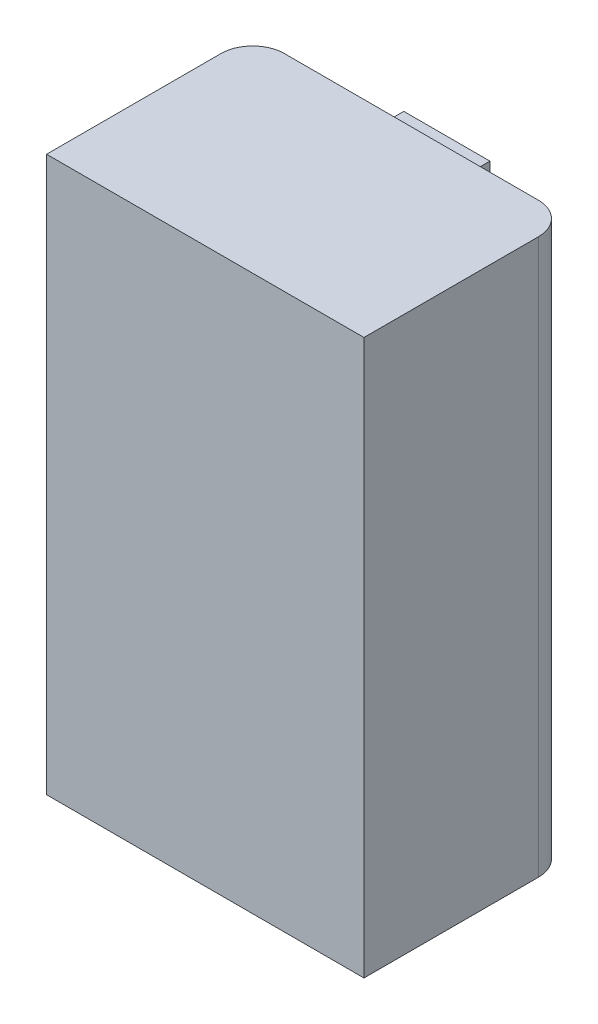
ISO-10303-21;
HEADER;
FILE_DESCRIPTION(('STEP AP214'),'2;1');
FILE_NAME('part.step','',(''),(''),'','','');
FILE_SCHEMA(('AUTOMOTIVE_DESIGN { 1 0 10303 214 1 1 1 1 }'));
ENDSEC;
DATA;
#1=APPLICATION_CONTEXT('core data for automotive mechanical design processes');
#2=APPLICATION_PROTOCOL_DEFINITION('international standard','automotive_design',2000,#1);
#3=PRODUCT_CONTEXT('',#1,'mechanical');
#4=PRODUCT('Part','Part','',(#3));
#5=PRODUCT_RELATED_PRODUCT_CATEGORY('part','',(#4));
#6=PRODUCT_DEFINITION_FORMATION('','',#4);
#7=PRODUCT_DEFINITION_CONTEXT('part definition',#1,'design');
#8=PRODUCT_DEFINITION('design','',#6,#7);
#9=PRODUCT_DEFINITION_SHAPE('','',#8);
#10=(LENGTH_UNIT() NAMED_UNIT(*) SI_UNIT(.MILLI.,.METRE.));
#11=(NAMED_UNIT(*) PLANE_ANGLE_UNIT() SI_UNIT($,.RADIAN.));
#12=(NAMED_UNIT(*) SI_UNIT($,.STERADIAN.) SOLID_ANGLE_UNIT());
#13=UNCERTAINTY_MEASURE_WITH_UNIT(LENGTH_MEASURE(1.E-05),#10,'distance_accuracy_value','');
#14=(GEOMETRIC_REPRESENTATION_CONTEXT(3) GLOBAL_UNCERTAINTY_ASSIGNED_CONTEXT((#13)) GLOBAL_UNIT_ASSIGNED_CONTEXT((#10,
#11,#12)) REPRESENTATION_CONTEXT('',''));
#15=CARTESIAN_POINT('',(0.,0.,0.));
#16=DIRECTION('',(0.,0.,1.));
#17=DIRECTION('',(1.,0.,0.));
#18=AXIS2_PLACEMENT_3D('',#15,#16,#17);
#19=CARTESIAN_POINT('',(0.,35.,-13.0038478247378));
#20=DIRECTION('',(0.,0.,1.));
#21=DIRECTION('',(1.,0.,0.));
#22=AXIS2_PLACEMENT_3D('',#19,#20,#21);
#23=PLANE('',#22);
#24=DIRECTION('',(0.,-1.,0.));
#25=VECTOR('',#24,1.);
#26=CARTESIAN_POINT('',(12.5019916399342,2.45659848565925,-13.0038478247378));
#27=LINE('',#26,#25);
#28=CARTESIAN_POINT('',(12.5019916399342,2.45659848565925,-13.0038478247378));
#29=VERTEX_POINT('',#28);
#30=CARTESIAN_POINT('',(12.5019916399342,0.0744423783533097,-13.0038478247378));
#31=VERTEX_POINT('',#30);
#32=EDGE_CURVE('E378',#29,#31,#27,.T.);
#33=ORIENTED_EDGE('',*,*,#32,.T.);
#34=DIRECTION('',(1.,0.,0.));
#35=VECTOR('',#34,1.);
#36=CARTESIAN_POINT('',(12.5019916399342,0.0744423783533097,-13.0038478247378));
#37=LINE('',#36,#35);
#38=CARTESIAN_POINT('',(13.4697425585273,0.0744423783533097,-13.0038478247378));
#39=VERTEX_POINT('',#38);
#40=EDGE_CURVE('E1260',#31,#39,#37,.T.);
#41=ORIENTED_EDGE('',*,*,#40,.T.);
#42=DIRECTION('',(0.,1.,0.));
#43=VECTOR('',#42,1.);
#44=CARTESIAN_POINT('',(13.4697425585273,0.0744423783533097,-13.0038478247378));
#45=LINE('',#44,#43);
#46=CARTESIAN_POINT('',(13.4697425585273,6.84869880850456,-13.0038478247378));
#47=VERTEX_POINT('',#46);
#48=EDGE_CURVE('E357',#39,#47,#45,.T.);
#49=ORIENTED_EDGE('',*,*,#48,.T.);
#50=DIRECTION('',(-1.,0.,0.));
#51=VECTOR('',#50,1.);
#52=CARTESIAN_POINT('',(13.4697425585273,6.84869880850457,-13.0038478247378));
#53=LINE('',#52,#51);
#54=CARTESIAN_POINT('',(12.5019916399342,6.84869880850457,-13.0038478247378));
#55=VERTEX_POINT('',#54);
#56=EDGE_CURVE('E50',#47,#55,#53,.T.);
#57=ORIENTED_EDGE('',*,*,#56,.T.);
#58=DIRECTION('',(0.,-1.,0.));
#59=VECTOR('',#58,1.);
#60=CARTESIAN_POINT('',(12.5019916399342,6.84869880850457,-13.0038478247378));
#61=LINE('',#60,#59);
#62=CARTESIAN_POINT('',(12.5019916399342,4.2432155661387,-13.0038478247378));
#63=VERTEX_POINT('',#62);
#64=EDGE_CURVE('E1264',#55,#63,#61,.T.);
#65=ORIENTED_EDGE('',*,*,#64,.T.);
#66=DIRECTION('',(-1.,0.,0.));
#67=VECTOR('',#66,1.);
#68=CARTESIAN_POINT('',(12.5019916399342,4.2432155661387,-13.0038478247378));
#69=LINE('',#68,#67);
#70=CARTESIAN_POINT('',(9.39518550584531,4.2432155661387,-13.0038478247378));
#71=VERTEX_POINT('',#70);
#72=EDGE_CURVE('E1267',#63,#71,#69,.T.);
#73=ORIENTED_EDGE('',*,*,#72,.T.);
#74=CARTESIAN_POINT('',(9.39518550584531,4.2432155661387,-13.0038478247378));
#75=CARTESIAN_POINT('',(9.45013022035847,4.339001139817,-13.0038478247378));
#76=CARTESIAN_POINT('',(9.55943938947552,4.52956071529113,-13.0038478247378));
#77=CARTESIAN_POINT('',(9.71051870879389,4.81993458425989,-13.0038478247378));
#78=CARTESIAN_POINT('',(9.84769021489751,5.11291986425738,-13.0038478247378));
#79=CARTESIAN_POINT('',(9.97402766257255,5.40683166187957,-13.0038478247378));
#80=CARTESIAN_POINT('',(10.085642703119,5.70393890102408,-13.0038478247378));
#81=CARTESIAN_POINT('',(10.1838627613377,6.00302635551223,-13.0038478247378));
#82=CARTESIAN_POINT('',(10.2728133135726,6.30311597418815,-13.0038478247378));
#83=CARTESIAN_POINT('',(10.3197466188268,6.5056916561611,-13.0038478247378));
#84=CARTESIAN_POINT('',(10.3431626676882,6.60676107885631,-13.0038478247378));
#85=B_SPLINE_CURVE_WITH_KNOTS('',3,(#74,#75,#76,#77,#78,#79,#80,#81,#82,#83,#84),.UNSPECIFIED.,
.F.,.F.,(4,1,1,1,1,1,1,1,4),(0.,0.129544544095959,0.257720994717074,0.383883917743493,
0.509015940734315,0.632958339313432,0.756090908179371,0.878308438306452,1.),.UNSPECIFIED.);
#86=CARTESIAN_POINT('',(10.3431626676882,6.60676107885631,-13.0038478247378));
#87=VERTEX_POINT('',#86);
#88=EDGE_CURVE('E1270',#71,#87,#85,.T.);
#89=ORIENTED_EDGE('',*,*,#88,.T.);
#90=DIRECTION('',(-1.,0.,0.));
#91=VECTOR('',#90,1.);
#92=CARTESIAN_POINT('',(10.3431626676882,6.60676107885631,-13.0038478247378));
#93=LINE('',#92,#91);
#94=CARTESIAN_POINT('',(9.2416481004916,6.60676107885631,-13.0038478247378));
#95=VERTEX_POINT('',#94);
#96=EDGE_CURVE('E1275',#87,#95,#93,.T.);
#97=ORIENTED_EDGE('',*,*,#96,.T.);
#98=CARTESIAN_POINT('',(9.2416481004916,6.60676107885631,-13.0038478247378));
#99=CARTESIAN_POINT('',(9.22086359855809,6.51677386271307,-13.0038478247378));
#100=CARTESIAN_POINT('',(9.18132800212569,6.34560313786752,-13.0038478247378));
#101=CARTESIAN_POINT('',(9.12274137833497,6.10269452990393,-13.0038478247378));
#102=CARTESIAN_POINT('',(9.07100632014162,5.8864884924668,-13.0038478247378));
#103=CARTESIAN_POINT('',(9.02341154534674,5.69801629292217,-13.0038478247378));
#104=CARTESIAN_POINT('',(8.98031842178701,5.53671998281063,-13.0038478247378));
#105=CARTESIAN_POINT('',(8.94210069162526,5.40261374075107,-13.0038478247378));
#106=CARTESIAN_POINT('',(8.91020564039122,5.29524333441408,-13.0038478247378));
#107=CARTESIAN_POINT('',(8.88066208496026,5.20968354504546,-13.0038478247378));
#108=CARTESIAN_POINT('',(8.84840051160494,5.13484296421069,-13.0038478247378));
#109=CARTESIAN_POINT('',(8.81494044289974,5.056626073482,-13.0038478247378));
#110=CARTESIAN_POINT('',(8.77552370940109,4.9702610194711,-13.0038478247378));
#111=CARTESIAN_POINT('',(8.72808280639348,4.87705254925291,-13.0038478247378));
#112=CARTESIAN_POINT('',(8.67928222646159,4.77389031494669,-13.0038478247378));
#113=CARTESIAN_POINT('',(8.62104030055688,4.66459279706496,-13.0038478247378));
#114=CARTESIAN_POINT('',(8.55891302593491,4.54657156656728,-13.0038478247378));
#115=CARTESIAN_POINT('',(8.4924933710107,4.42313616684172,-13.0038478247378));
#116=CARTESIAN_POINT('',(8.42542937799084,4.29983119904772,-13.0038478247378));
#117=CARTESIAN_POINT('',(8.35435394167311,4.18508857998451,-13.0038478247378));
#118=CARTESIAN_POINT('',(8.2880395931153,4.07716162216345,-13.0038478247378));
#119=CARTESIAN_POINT('',(8.21959853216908,3.98020218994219,-13.0038478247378));
#120=CARTESIAN_POINT('',(8.15579400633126,3.88972682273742,-13.0038478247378));
#121=CARTESIAN_POINT('',(8.08961096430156,3.81084196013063,-13.0038478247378));
#122=CARTESIAN_POINT('',(8.02649755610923,3.73930034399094,-13.0038478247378));
#123=CARTESIAN_POINT('',(7.98223187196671,3.69702604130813,-13.0038478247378));
#124=CARTESIAN_POINT('',(7.96100656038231,3.67675559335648,-13.0038478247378));
#125=B_SPLINE_CURVE_WITH_KNOTS('',3,(#98,#99,#100,#101,#102,#103,#104,#105,#106,#107,#108,#109,
#110,#111,#112,#113,#114,#115,#116,#117,#118,#119,#120,#121,#122,#123,#124),.UNSPECIFIED.,.F.,
.F.,(4,1,1,1,1,1,1,1,1,1,1,1,1,1,1,1,1,1,1,1,1,1,1,1,4),(0.,0.0854901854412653,
0.162616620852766,0.23129763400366,0.291272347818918,0.342549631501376,0.385833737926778,
0.42034775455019,0.446228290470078,0.469556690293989,0.495758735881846,0.524986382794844,
0.55740864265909,0.592560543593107,0.630605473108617,0.67202677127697,0.716023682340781,
0.760364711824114,0.801911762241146,0.840944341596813,0.877580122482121,0.911750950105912,
0.943366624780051,0.972844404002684,1.),.UNSPECIFIED.);
#126=CARTESIAN_POINT('',(7.96100656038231,3.67675559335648,-13.0038478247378));
#127=VERTEX_POINT('',#126);
#128=EDGE_CURVE('E1281',#95,#127,#125,.T.);
#129=ORIENTED_EDGE('',*,*,#128,.T.);
#130=DIRECTION('',(0.,-1.,0.));
#131=VECTOR('',#130,1.);
#132=CARTESIAN_POINT('',(7.96100656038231,3.67675559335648,-13.0038478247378));
#133=LINE('',#132,#131);
#134=CARTESIAN_POINT('',(7.96100656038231,2.45659848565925,-13.0038478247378));
#135=VERTEX_POINT('',#134);
#136=EDGE_CURVE('E1286',#127,#135,#133,.T.);
#137=ORIENTED_EDGE('',*,*,#136,.T.);
#138=DIRECTION('',(1.,0.,0.));
#139=VECTOR('',#138,1.);
#140=CARTESIAN_POINT('',(7.96100656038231,2.45659848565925,-13.0038478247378));
#141=LINE('',#140,#139);
#142=EDGE_CURVE('E381',#135,#29,#141,.T.);
#143=ORIENTED_EDGE('',*,*,#142,.T.);
#144=EDGE_LOOP('',(#33,#41,#49,#57,#65,#73,#89,#97,#129,#137,#143));
#145=FACE_BOUND('',#144,.T.);
#146=DIRECTION('',(0.76009213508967,0.64981531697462,0.));
#147=VECTOR('',#146,1.);
#148=CARTESIAN_POINT('',(8.03544893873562,11.0979554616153,-13.0038478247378));
#149=LINE('',#148,#147);
#150=CARTESIAN_POINT('',(8.03544893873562,11.0979554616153,-13.0038478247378));
#151=VERTEX_POINT('',#150);
#152=CARTESIAN_POINT('',(11.1701709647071,13.7778810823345,-13.0038478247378));
#153=VERTEX_POINT('',#152);
#154=EDGE_CURVE('E1317',#151,#153,#149,.T.);
#155=ORIENTED_EDGE('',*,*,#154,.T.);
#156=DIRECTION('',(1.,0.,0.));
#157=VECTOR('',#156,1.);
#158=CARTESIAN_POINT('',(11.1701709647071,13.7778810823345,-13.0038478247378));
#159=LINE('',#158,#157);
#160=CARTESIAN_POINT('',(13.4697425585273,13.7778810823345,-13.0038478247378));
#161=VERTEX_POINT('',#160);
#162=EDGE_CURVE('E1295',#153,#161,#159,.T.);
#163=ORIENTED_EDGE('',*,*,#162,.T.);
#164=DIRECTION('',(0.,1.,0.));
#165=VECTOR('',#164,1.);
#166=CARTESIAN_POINT('',(13.4697425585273,13.7778810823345,-13.0038478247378));
#167=LINE('',#166,#165);
#168=CARTESIAN_POINT('',(13.4697425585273,15.6389405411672,-13.0038478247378));
#169=VERTEX_POINT('',#168);
#170=EDGE_CURVE('E1344',#161,#169,#167,.T.);
#171=ORIENTED_EDGE('',*,*,#170,.T.);
#172=DIRECTION('',(-1.,0.,0.));
#173=VECTOR('',#172,1.);
#174=CARTESIAN_POINT('',(13.4697425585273,15.6389405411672,-13.0038478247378));
#175=LINE('',#174,#173);
#176=CARTESIAN_POINT('',(11.1934342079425,15.6389405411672,-13.0038478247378));
#177=VERTEX_POINT('',#176);
#178=EDGE_CURVE('E58',#169,#177,#175,.T.);
#179=ORIENTED_EDGE('',*,*,#178,.T.);
#180=DIRECTION('',(-0.736174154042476,0.676792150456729,0.));
#181=VECTOR('',#180,1.);
#182=CARTESIAN_POINT('',(11.1934342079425,15.6389405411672,-13.0038478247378));
#183=LINE('',#182,#181);
#184=CARTESIAN_POINT('',(8.03544893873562,18.5421932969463,-13.0038478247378));
#185=VERTEX_POINT('',#184);
#186=EDGE_CURVE('E1348',#177,#185,#183,.T.);
#187=ORIENTED_EDGE('',*,*,#186,.T.);
#188=DIRECTION('',(0.,-1.,0.));
#189=VECTOR('',#188,1.);
#190=CARTESIAN_POINT('',(8.03544893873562,18.5421932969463,-13.0038478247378));
#191=LINE('',#190,#189);
#192=CARTESIAN_POINT('',(8.03544893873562,16.5229437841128,-13.0038478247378));
#193=VERTEX_POINT('',#192);
#194=EDGE_CURVE('E1351',#185,#193,#191,.T.);
#195=ORIENTED_EDGE('',*,*,#194,.T.);
#196=DIRECTION('',(0.735324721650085,-0.677714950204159,0.));
#197=VECTOR('',#196,1.);
#198=CARTESIAN_POINT('',(8.03544893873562,16.5229437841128,-13.0038478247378));
#199=LINE('',#198,#197);
#200=CARTESIAN_POINT('',(10.1733409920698,14.5525470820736,-13.0038478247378));
#201=VERTEX_POINT('',#200);
#202=EDGE_CURVE('E1354',#193,#201,#199,.T.);
#203=ORIENTED_EDGE('',*,*,#202,.T.);
#204=DIRECTION('',(-0.761591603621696,-0.648057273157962,0.));
#205=VECTOR('',#204,1.);
#206=CARTESIAN_POINT('',(10.1733409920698,14.5525470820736,-13.0038478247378));
#207=LINE('',#206,#205);
#208=CARTESIAN_POINT('',(8.03544893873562,12.7333614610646,-13.0038478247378));
#209=VERTEX_POINT('',#208);
#210=EDGE_CURVE('E1357',#201,#209,#207,.T.);
#211=ORIENTED_EDGE('',*,*,#210,.T.);
#212=DIRECTION('',(0.,-1.,0.));
#213=VECTOR('',#212,1.);
#214=CARTESIAN_POINT('',(8.03544893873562,12.7333614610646,-13.0038478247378));
#215=LINE('',#214,#213);
#216=EDGE_CURVE('E1360',#209,#151,#215,.T.);
#217=ORIENTED_EDGE('',*,*,#216,.T.);
#218=EDGE_LOOP('',(#155,#163,#171,#179,#187,#195,#203,#211,#217));
#219=FACE_BOUND('',#218,.T.);
#220=DIRECTION('',(-1.,0.,0.));
#221=VECTOR('',#220,1.);
#222=CARTESIAN_POINT('',(11.5133038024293,20.7040428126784,-13.0038478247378));
#223=LINE('',#222,#221);
#224=CARTESIAN_POINT('',(11.5133038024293,20.7040428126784,-13.0038478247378));
#225=VERTEX_POINT('',#224);
#226=CARTESIAN_POINT('',(8.03544893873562,20.7040428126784,-13.0038478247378));
#227=VERTEX_POINT('',#226);
#228=EDGE_CURVE('E546',#225,#227,#223,.T.);
#229=ORIENTED_EDGE('',*,*,#228,.T.);
#230=DIRECTION('',(0.,-1.,0.));
#231=VECTOR('',#230,1.);
#232=CARTESIAN_POINT('',(8.03544893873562,20.7040428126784,-13.0038478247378));
#233=LINE('',#232,#231);
#234=CARTESIAN_POINT('',(8.03544893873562,19.2896376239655,-13.0038478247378));
#235=VERTEX_POINT('',#234);
#236=EDGE_CURVE('E501',#227,#235,#233,.T.);
#237=ORIENTED_EDGE('',*,*,#236,.T.);
#238=DIRECTION('',(1.,0.,0.));
#239=VECTOR('',#238,1.);
#240=CARTESIAN_POINT('',(8.03544893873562,19.2896376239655,-13.0038478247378));
#241=LINE('',#240,#239);
#242=CARTESIAN_POINT('',(11.5016721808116,19.2896376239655,-13.0038478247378));
#243=VERTEX_POINT('',#242);
#244=EDGE_CURVE('E504',#235,#243,#241,.T.);
#245=ORIENTED_EDGE('',*,*,#244,.T.);
#246=CARTESIAN_POINT('',(11.5016721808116,19.2896376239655,-13.0038478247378));
#247=CARTESIAN_POINT('',(11.5579051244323,19.2907062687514,-13.0038478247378));
#248=CARTESIAN_POINT('',(11.6670029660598,19.2927795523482,-13.0038478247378));
#249=CARTESIAN_POINT('',(11.8263722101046,19.3037781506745,-13.0038478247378));
#250=CARTESIAN_POINT('',(11.9757368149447,19.3252152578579,-13.0038478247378));
#251=CARTESIAN_POINT('',(12.1167809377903,19.3522756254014,-13.0038478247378));
#252=CARTESIAN_POINT('',(12.2475046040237,19.3899120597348,-13.0038478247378));
#253=CARTESIAN_POINT('',(12.3699390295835,19.4333805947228,-13.0038478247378));
#254=CARTESIAN_POINT('',(12.4814370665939,19.4876596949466,-13.0038478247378));
#255=CARTESIAN_POINT('',(12.5866360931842,19.5484457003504,-13.0038478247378));
#256=CARTESIAN_POINT('',(12.6839958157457,19.6229597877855,-13.0038478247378));
#257=CARTESIAN_POINT('',(12.7769300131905,19.7116680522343,-13.0038478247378));
#258=CARTESIAN_POINT('',(12.866145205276,19.8155320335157,-13.0038478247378));
#259=CARTESIAN_POINT('',(12.9522223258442,19.9347530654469,-13.0038478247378));
#260=CARTESIAN_POINT('',(13.0347427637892,20.0695989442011,-13.0038478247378));
#261=CARTESIAN_POINT('',(13.1147363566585,20.2189579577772,-13.0038478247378));
#262=CARTESIAN_POINT('',(13.1900163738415,20.3845139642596,-13.0038478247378));
#263=CARTESIAN_POINT('',(13.2634089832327,20.5632241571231,-13.0038478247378));
#264=CARTESIAN_POINT('',(13.3288762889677,20.7556211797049,-13.0038478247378));
#265=CARTESIAN_POINT('',(13.3872686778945,20.9581104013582,-13.0038478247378));
#266=CARTESIAN_POINT('',(13.4361736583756,21.1705067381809,-13.0038478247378));
#267=CARTESIAN_POINT('',(13.4749226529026,21.3923326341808,-13.0038478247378));
#268=CARTESIAN_POINT('',(13.5069369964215,21.6238764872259,-13.0038478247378));
#269=CARTESIAN_POINT('',(13.5284605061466,21.8649272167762,-13.0038478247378));
#270=CARTESIAN_POINT('',(13.5413550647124,22.1159795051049,-13.0038478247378));
#271=CARTESIAN_POINT('',(13.5432291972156,22.286315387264,-13.0038478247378));
#272=CARTESIAN_POINT('',(13.5441849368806,22.373180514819,-13.0038478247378));
#273=B_SPLINE_CURVE_WITH_KNOTS('',3,(#246,#247,#248,#249,#250,#251,#252,#253,#254,#255,#256,
#257,#258,#259,#260,#261,#262,#263,#264,#265,#266,#267,#268,#269,#270,#271,#272),.UNSPECIFIED.,
.F.,.F.,(4,1,1,1,1,1,1,1,1,1,1,1,1,1,1,1,1,1,1,1,1,1,1,1,4),(0.,0.040102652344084,
0.0778033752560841,0.113812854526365,0.147645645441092,0.180114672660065,0.210726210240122,
0.240156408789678,0.268415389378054,0.297223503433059,0.327339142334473,0.359875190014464,
0.394714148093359,0.432078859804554,0.472524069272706,0.515448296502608,0.561704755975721,
0.610228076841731,0.660279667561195,0.711918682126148,0.76555357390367,0.820800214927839,
0.878544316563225,0.938062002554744,1.),.UNSPECIFIED.);
#274=CARTESIAN_POINT('',(13.5441849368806,22.373180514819,-13.0038478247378));
#275=VERTEX_POINT('',#274);
#276=EDGE_CURVE('E508',#243,#275,#273,.T.);
#277=ORIENTED_EDGE('',*,*,#276,.T.);
#278=CARTESIAN_POINT('',(13.5441849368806,22.373180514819,-13.0038478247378));
#279=CARTESIAN_POINT('',(13.5436446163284,22.4584936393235,-13.0038478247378));
#280=CARTESIAN_POINT('',(13.5425855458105,22.6257140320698,-13.0038478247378));
#281=CARTESIAN_POINT('',(13.5305152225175,22.8704863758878,-13.0038478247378));
#282=CARTESIAN_POINT('',(13.5120102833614,23.1040147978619,-13.0038478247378));
#283=CARTESIAN_POINT('',(13.4870470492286,23.326091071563,-13.0038478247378));
#284=CARTESIAN_POINT('',(13.4531789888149,23.5367560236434,-13.0038478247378));
#285=CARTESIAN_POINT('',(13.4124315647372,23.7362238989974,-13.0038478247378));
#286=CARTESIAN_POINT('',(13.3655774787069,23.9244671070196,-13.0038478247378));
#287=CARTESIAN_POINT('',(13.3096289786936,24.100717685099,-13.0038478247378));
#288=CARTESIAN_POINT('',(13.2460098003,24.2647217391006,-13.0038478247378));
#289=CARTESIAN_POINT('',(13.1800102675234,24.4188374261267,-13.0038478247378));
#290=CARTESIAN_POINT('',(13.1045696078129,24.5594431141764,-13.0038478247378));
#291=CARTESIAN_POINT('',(13.026150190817,24.689934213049,-13.0038478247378));
#292=CARTESIAN_POINT('',(12.9394327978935,24.8069200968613,-13.0038478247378));
#293=CARTESIAN_POINT('',(12.8493237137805,24.914349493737,-13.0038478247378));
#294=CARTESIAN_POINT('',(12.750360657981,25.0068843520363,-13.0038478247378));
#295=CARTESIAN_POINT('',(12.6481043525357,25.0910709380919,-13.0038478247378));
#296=CARTESIAN_POINT('',(12.5368567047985,25.1619953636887,-13.0038478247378));
#297=CARTESIAN_POINT('',(12.4201179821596,25.2249547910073,-13.0038478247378));
#298=CARTESIAN_POINT('',(12.2953946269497,25.2775076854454,-13.0038478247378));
#299=CARTESIAN_POINT('',(12.1643479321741,25.3205869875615,-13.0038478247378));
#300=CARTESIAN_POINT('',(12.0256055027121,25.3526538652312,-13.0038478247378));
#301=CARTESIAN_POINT('',(11.8808349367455,25.3774410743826,-13.0038478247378));
#302=CARTESIAN_POINT('',(11.7283731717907,25.3913235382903,-13.0038478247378));
#303=CARTESIAN_POINT('',(11.6246065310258,25.3930357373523,-13.0038478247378));
#304=CARTESIAN_POINT('',(11.5714619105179,25.3939126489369,-13.0038478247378));
#305=B_SPLINE_CURVE_WITH_KNOTS('',3,(#278,#279,#280,#281,#282,#283,#284,#285,#286,#287,#288,
#289,#290,#291,#292,#293,#294,#295,#296,#297,#298,#299,#300,#301,#302,#303,#304),.UNSPECIFIED.,
.F.,.F.,(4,1,1,1,1,1,1,1,1,1,1,1,1,1,1,1,1,1,1,1,1,1,1,1,4),(0.,0.0625021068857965,
0.122509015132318,0.179505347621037,0.2341222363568,0.286195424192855,0.335779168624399,
0.383250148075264,0.428260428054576,0.471151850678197,0.512109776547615,0.55099473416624,
0.587973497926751,0.623541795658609,0.657589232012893,0.690541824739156,0.722662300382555,
0.75449507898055,0.787029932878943,0.819742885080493,0.853520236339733,0.887971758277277,
0.923978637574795,0.961065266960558,1.),.UNSPECIFIED.);
#306=CARTESIAN_POINT('',(11.5714619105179,25.3939126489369,-13.0038478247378));
#307=VERTEX_POINT('',#306);
#308=EDGE_CURVE('E513',#275,#307,#305,.T.);
#309=ORIENTED_EDGE('',*,*,#308,.T.);
#310=DIRECTION('',(-1.,0.,0.));
#311=VECTOR('',#310,1.);
#312=CARTESIAN_POINT('',(11.5714619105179,25.3939126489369,-13.0038478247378));
#313=LINE('',#312,#311);
#314=CARTESIAN_POINT('',(8.03544893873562,25.3939126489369,-13.0038478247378));
#315=VERTEX_POINT('',#314);
#316=EDGE_CURVE('E521',#307,#315,#313,.T.);
#317=ORIENTED_EDGE('',*,*,#316,.T.);
#318=DIRECTION('',(0.,-1.,0.));
#319=VECTOR('',#318,1.);
#320=CARTESIAN_POINT('',(8.03544893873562,25.3939126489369,-13.0038478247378));
#321=LINE('',#320,#319);
#322=CARTESIAN_POINT('',(8.03544893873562,23.6072955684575,-13.0038478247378));
#323=VERTEX_POINT('',#322);
#324=EDGE_CURVE('E527',#315,#323,#321,.T.);
#325=ORIENTED_EDGE('',*,*,#324,.T.);
#326=DIRECTION('',(1.,0.,0.));
#327=VECTOR('',#326,1.);
#328=CARTESIAN_POINT('',(8.03544893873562,23.6072955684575,-13.0038478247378));
#329=LINE('',#328,#327);
#330=CARTESIAN_POINT('',(11.5133038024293,23.6072955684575,-13.0038478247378));
#331=VERTEX_POINT('',#330);
#332=EDGE_CURVE('E530',#323,#331,#329,.T.);
#333=ORIENTED_EDGE('',*,*,#332,.T.);
#334=CARTESIAN_POINT('',(11.5133038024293,23.6072955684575,-13.0038478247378));
#335=CARTESIAN_POINT('',(11.5668510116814,23.6058186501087,-13.0038478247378));
#336=CARTESIAN_POINT('',(11.6696352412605,23.6029836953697,-13.0038478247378));
#337=CARTESIAN_POINT('',(11.8165108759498,23.5854373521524,-13.0038478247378));
#338=CARTESIAN_POINT('',(11.9483725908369,23.552496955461,-13.0038478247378));
#339=CARTESIAN_POINT('',(12.0661652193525,23.5079790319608,-13.0038478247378));
#340=CARTESIAN_POINT('',(12.1682815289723,23.4479501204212,-13.0038478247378));
#341=CARTESIAN_POINT('',(12.2564527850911,23.3759367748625,-13.0038478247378));
#342=CARTESIAN_POINT('',(12.3298488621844,23.2904700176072,-13.0038478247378));
#343=CARTESIAN_POINT('',(12.4031198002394,23.1560357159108,-13.0038478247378));
#344=CARTESIAN_POINT('',(12.4727482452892,22.970682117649,-13.0038478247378));
#345=CARTESIAN_POINT('',(12.5326000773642,22.730908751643,-13.0038478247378));
#346=CARTESIAN_POINT('',(12.5709792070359,22.471337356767,-13.0038478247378));
#347=CARTESIAN_POINT('',(12.5745771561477,22.2915120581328,-13.0038478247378));
#348=CARTESIAN_POINT('',(12.5764340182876,22.1987061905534,-13.0038478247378));
#349=B_SPLINE_CURVE_WITH_KNOTS('',3,(#334,#335,#336,#337,#338,#339,#340,#341,#342,#343,#344,
#345,#346,#347,#348),.UNSPECIFIED.,.F.,.F.,(4,1,1,1,1,1,1,1,1,1,1,1,4),(0.,0.0787994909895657,
0.151256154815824,0.217115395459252,0.278347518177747,0.335877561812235,0.390586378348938,
0.44522376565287,0.500415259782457,0.614933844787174,0.735584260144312,0.863537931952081,1.),.UNSPECIFIED.);
#350=CARTESIAN_POINT('',(12.5764340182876,22.1987061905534,-13.0038478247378));
#351=VERTEX_POINT('',#350);
#352=EDGE_CURVE('E533',#331,#351,#349,.T.);
#353=ORIENTED_EDGE('',*,*,#352,.T.);
#354=CARTESIAN_POINT('',(12.5764340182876,22.1987061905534,-13.0038478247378));
#355=CARTESIAN_POINT('',(12.5757757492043,22.1424729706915,-13.0038478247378));
#356=CARTESIAN_POINT('',(12.5744897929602,22.0326190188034,-13.0038478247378));
#357=CARTESIAN_POINT('',(12.5641842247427,21.8726395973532,-13.0038478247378));
#358=CARTESIAN_POINT('',(12.5461829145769,21.7217888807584,-13.0038478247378));
#359=CARTESIAN_POINT('',(12.5243772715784,21.579992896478,-13.0038478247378));
#360=CARTESIAN_POINT('',(12.4917517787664,21.4479673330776,-13.0038478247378));
#361=CARTESIAN_POINT('',(12.4558768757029,21.3240524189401,-13.0038478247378));
#362=CARTESIAN_POINT('',(12.4096141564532,21.2102863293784,-13.0038478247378));
#363=CARTESIAN_POINT('',(12.3594368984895,21.1041723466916,-13.0038478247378));
#364=CARTESIAN_POINT('',(12.2982634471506,21.0090342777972,-13.0038478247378));
#365=CARTESIAN_POINT('',(12.2228140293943,20.9270041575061,-13.0038478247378));
#366=CARTESIAN_POINT('',(12.135727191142,20.8568507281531,-13.0038478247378));
#367=CARTESIAN_POINT('',(12.0346252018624,20.8009559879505,-13.0038478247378));
#368=CARTESIAN_POINT('',(11.9223164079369,20.7559087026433,-13.0038478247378));
#369=CARTESIAN_POINT('',(11.7966163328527,20.7275952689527,-13.0038478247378));
#370=CARTESIAN_POINT('',(11.659428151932,20.706122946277,-13.0038478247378));
#371=CARTESIAN_POINT('',(11.5634182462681,20.704756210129,-13.0038478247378));
#372=CARTESIAN_POINT('',(11.5133038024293,20.7040428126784,-13.0038478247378));
#373=B_SPLINE_CURVE_WITH_KNOTS('',3,(#354,#355,#356,#357,#358,#359,#360,#361,#362,#363,#364,
#365,#366,#367,#368,#369,#370,#371,#372),.UNSPECIFIED.,.F.,.F.,(4,1,1,1,1,1,1,1,1,1,1,1,1,1,1,1,
4),(0.,0.0799524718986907,0.156190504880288,0.227784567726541,0.295938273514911,
0.359986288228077,0.4210265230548,0.479172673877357,0.534399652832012,0.587762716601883,
0.639271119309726,0.692219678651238,0.746033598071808,0.802951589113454,0.86365482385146,
0.928831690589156,1.),.UNSPECIFIED.);
#374=EDGE_CURVE('E538',#351,#225,#373,.T.);
#375=ORIENTED_EDGE('',*,*,#374,.T.);
#376=EDGE_LOOP('',(#229,#237,#245,#277,#309,#317,#325,#333,#353,#375));
#377=FACE_BOUND('',#376,.T.);
#378=CARTESIAN_POINT('',(10.7619010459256,26.8857807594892,-13.0038478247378));
#379=CARTESIAN_POINT('',(10.8088423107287,26.8867645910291,-13.0038478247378));
#380=CARTESIAN_POINT('',(10.9021204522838,26.8887195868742,-13.0038478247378));
#381=CARTESIAN_POINT('',(11.0408791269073,26.9016647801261,-13.0038478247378));
#382=CARTESIAN_POINT('',(11.1769671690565,26.9235164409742,-13.0038478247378));
#383=CARTESIAN_POINT('',(11.3100678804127,26.9554354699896,-13.0038478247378));
#384=CARTESIAN_POINT('',(11.4402444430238,26.994876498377,-13.0038478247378));
#385=CARTESIAN_POINT('',(11.5681420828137,27.0424441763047,-13.0038478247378));
#386=CARTESIAN_POINT('',(11.692127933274,27.1009095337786,-13.0038478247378));
#387=CARTESIAN_POINT('',(11.813621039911,27.1680707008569,-13.0038478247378));
#388=CARTESIAN_POINT('',(11.9336169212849,27.2413474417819,-13.0038478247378));
#389=CARTESIAN_POINT('',(12.0487116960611,27.3268536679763,-13.0038478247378));
#390=CARTESIAN_POINT('',(12.1636299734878,27.4178133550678,-13.0038478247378));
#391=CARTESIAN_POINT('',(12.2729392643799,27.5207382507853,-13.0038478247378));
#392=CARTESIAN_POINT('',(12.3813042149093,27.6308964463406,-13.0038478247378));
#393=CARTESIAN_POINT('',(12.4863895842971,27.75020351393,-13.0038478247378));
#394=CARTESIAN_POINT('',(12.5888085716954,27.8783338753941,-13.0038478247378));
#395=CARTESIAN_POINT('',(12.6878987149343,28.0148705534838,-13.0038478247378));
#396=CARTESIAN_POINT('',(12.7830331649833,28.1591710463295,-13.0038478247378));
#397=CARTESIAN_POINT('',(12.871252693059,28.3121573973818,-13.0038478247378));
#398=CARTESIAN_POINT('',(12.9540923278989,28.4719716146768,-13.0038478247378));
#399=CARTESIAN_POINT('',(13.0312544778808,28.6393964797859,-13.0038478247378));
#400=CARTESIAN_POINT('',(13.0997697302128,28.8152520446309,-13.0038478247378));
#401=CARTESIAN_POINT('',(13.1662921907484,28.997256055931,-13.0038478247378));
#402=CARTESIAN_POINT('',(13.2238502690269,29.1876834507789,-13.0038478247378));
#403=CARTESIAN_POINT('',(13.2743712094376,29.3859073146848,-13.0038478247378));
#404=CARTESIAN_POINT('',(13.3216092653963,29.5904139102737,-13.0038478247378));
#405=CARTESIAN_POINT('',(13.360854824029,29.8031747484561,-13.0038478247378));
#406=CARTESIAN_POINT('',(13.3941721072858,30.0231684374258,-13.0038478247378));
#407=CARTESIAN_POINT('',(13.4226006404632,30.2507692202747,-13.0038478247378));
#408=CARTESIAN_POINT('',(13.4429996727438,30.4859266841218,-13.0038478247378));
#409=CARTESIAN_POINT('',(13.4580407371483,30.7287141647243,-13.0038478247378));
#410=CARTESIAN_POINT('',(13.4675480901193,30.978873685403,-13.0038478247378));
#411=CARTESIAN_POINT('',(13.4690045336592,31.1479863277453,-13.0038478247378));
#412=CARTESIAN_POINT('',(13.4697425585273,31.2336809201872,-13.0038478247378));
#413=B_SPLINE_CURVE_WITH_KNOTS('',3,(#378,#379,#380,#381,#382,#383,#384,#385,#386,#387,#388,
#389,#390,#391,#392,#393,#394,#395,#396,#397,#398,#399,#400,#401,#402,#403,#404,#405,#406,#407,
#408,#409,#410,#411,#412),.UNSPECIFIED.,.F.,.F.,(4,1,1,1,1,1,1,1,1,1,1,1,1,1,1,1,1,1,1,1,1,1,1,
1,1,1,1,1,1,1,1,1,4),(0.,0.0247498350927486,0.0491810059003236,0.0734129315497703,
0.0973629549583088,0.121291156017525,0.145098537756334,0.169243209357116,0.193488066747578,
0.218278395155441,0.243303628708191,0.269036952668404,0.295509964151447,0.32239885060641,
0.350496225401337,0.379294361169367,0.408858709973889,0.439420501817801,0.470381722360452,
0.501926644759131,0.534309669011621,0.567526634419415,0.601410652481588,0.63646112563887,
0.672359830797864,0.709257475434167,0.747107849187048,0.786399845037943,0.826564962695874,
0.868023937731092,0.910832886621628,0.954816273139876,1.),.UNSPECIFIED.);
#414=CARTESIAN_POINT('',(10.7619010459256,26.8857807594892,-13.0038478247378));
#415=VERTEX_POINT('',#414);
#416=CARTESIAN_POINT('',(13.4697425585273,31.2336809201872,-13.0038478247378));
#417=VERTEX_POINT('',#416);
#418=EDGE_CURVE('E652',#415,#417,#413,.T.);
#419=ORIENTED_EDGE('',*,*,#418,.T.);
#420=DIRECTION('',(0.,1.,0.));
#421=VECTOR('',#420,1.);
#422=CARTESIAN_POINT('',(13.4697425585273,31.2336809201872,-13.0038478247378));
#423=LINE('',#422,#421);
#424=CARTESIAN_POINT('',(13.4697425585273,34.1066914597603,-13.0038478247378));
#425=VERTEX_POINT('',#424);
#426=EDGE_CURVE('E634',#417,#425,#423,.T.);
#427=ORIENTED_EDGE('',*,*,#426,.T.);
#428=DIRECTION('',(-1.,0.,0.));
#429=VECTOR('',#428,1.);
#430=CARTESIAN_POINT('',(13.4697425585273,34.1066914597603,-13.0038478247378));
#431=LINE('',#430,#429);
#432=CARTESIAN_POINT('',(8.03544893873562,34.1066914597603,-13.0038478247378));
#433=VERTEX_POINT('',#432);
#434=EDGE_CURVE('E640',#425,#433,#431,.T.);
#435=ORIENTED_EDGE('',*,*,#434,.T.);
#436=DIRECTION('',(0.,-1.,0.));
#437=VECTOR('',#436,1.);
#438=CARTESIAN_POINT('',(8.03544893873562,34.1066914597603,-13.0038478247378));
#439=LINE('',#438,#437);
#440=CARTESIAN_POINT('',(8.03544893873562,30.8893849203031,-13.0038478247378));
#441=VERTEX_POINT('',#440);
#442=EDGE_CURVE('E644',#433,#441,#439,.T.);
#443=ORIENTED_EDGE('',*,*,#442,.T.);
#444=CARTESIAN_POINT('',(8.03544893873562,30.8893849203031,-13.0038478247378));
#445=CARTESIAN_POINT('',(8.03785541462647,30.7423536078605,-13.0038478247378));
#446=CARTESIAN_POINT('',(8.04255577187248,30.4551703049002,-13.0038478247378));
#447=CARTESIAN_POINT('',(8.08062804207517,30.0355944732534,-13.0038478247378));
#448=CARTESIAN_POINT('',(8.14086294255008,29.6380839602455,-13.0038478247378));
#449=CARTESIAN_POINT('',(8.22866017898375,29.2629853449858,-13.0038478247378));
#450=CARTESIAN_POINT('',(8.33957190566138,28.9093002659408,-13.0038478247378));
#451=CARTESIAN_POINT('',(8.47683954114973,28.5779124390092,-13.0038478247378));
#452=CARTESIAN_POINT('',(8.63964986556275,28.269100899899,-13.0038478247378));
#453=CARTESIAN_POINT('',(8.79429622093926,28.0289951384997,-13.0038478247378));
#454=CARTESIAN_POINT('',(8.93048706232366,27.8522148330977,-13.0038478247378));
#455=CARTESIAN_POINT('',(9.03270018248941,27.7268302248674,-13.0038478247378));
#456=CARTESIAN_POINT('',(9.13829675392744,27.6103223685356,-13.0038478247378));
#457=CARTESIAN_POINT('',(9.2481090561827,27.5034979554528,-13.0038478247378));
#458=CARTESIAN_POINT('',(9.35937706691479,27.4042454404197,-13.0038478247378));
#459=CARTESIAN_POINT('',(9.47388635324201,27.3145455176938,-13.0038478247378));
#460=CARTESIAN_POINT('',(9.59035425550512,27.2329877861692,-13.0038478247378));
#461=CARTESIAN_POINT('',(9.70906201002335,27.1590096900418,-13.0038478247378));
#462=CARTESIAN_POINT('',(9.83178260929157,27.0950282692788,-13.0038478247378));
#463=CARTESIAN_POINT('',(9.95708691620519,27.0396776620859,-13.0038478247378));
#464=CARTESIAN_POINT('',(10.0844493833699,26.9909496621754,-13.0038478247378));
#465=CARTESIAN_POINT('',(10.2149780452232,26.9532331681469,-13.0038478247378));
#466=CARTESIAN_POINT('',(10.3476535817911,26.9223740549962,-13.0038478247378));
#467=CARTESIAN_POINT('',(10.4834041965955,26.9018886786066,-13.0038478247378));
#468=CARTESIAN_POINT('',(10.6216716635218,26.8886517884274,-13.0038478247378));
#469=CARTESIAN_POINT('',(10.7149564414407,26.8867418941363,-13.0038478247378));
#470=CARTESIAN_POINT('',(10.7619010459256,26.8857807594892,-13.0038478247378));
#471=B_SPLINE_CURVE_WITH_KNOTS('',3,(#444,#445,#446,#447,#448,#449,#450,#451,#452,#453,#454,
#455,#456,#457,#458,#459,#460,#461,#462,#463,#464,#465,#466,#467,#468,#469,#470),.UNSPECIFIED.,
.F.,.F.,(4,1,1,1,1,1,1,1,1,1,1,1,1,1,1,1,1,1,1,1,1,1,1,1,4),(0.,0.0820545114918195,
0.160269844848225,0.234952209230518,0.306291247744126,0.375076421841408,0.441631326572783,
0.506199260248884,0.569706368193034,0.600740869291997,0.63072226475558,0.659982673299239,
0.688447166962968,0.716195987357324,0.743167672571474,0.769584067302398,0.795529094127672,
0.821180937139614,0.846757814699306,0.871960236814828,0.897228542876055,0.922532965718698,
0.947937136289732,0.97379989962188,1.),.UNSPECIFIED.);
#472=EDGE_CURVE('E647',#441,#415,#471,.T.);
#473=ORIENTED_EDGE('',*,*,#472,.T.);
#474=EDGE_LOOP('',(#419,#427,#435,#443,#473));
#475=FACE_BOUND('',#474,.T.);
#476=DIRECTION('',(-1.,0.,0.));
#477=VECTOR('',#476,1.);
#478=CARTESIAN_POINT('',(0.,35.,-13.0038478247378));
#479=LINE('',#478,#477);
#480=CARTESIAN_POINT('',(18.0259256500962,35.,-13.0038478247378));
#481=VERTEX_POINT('',#480);
#482=CARTESIAN_POINT('',(2.,35.,-13.0038478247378));
#483=VERTEX_POINT('',#482);
#484=EDGE_CURVE('E715',#481,#483,#479,.T.);
#485=ORIENTED_EDGE('',*,*,#484,.F.);
#486=DIRECTION('',(0.,-1.,0.));
#487=VECTOR('',#486,1.);
#488=CARTESIAN_POINT('',(18.0259256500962,35.,-13.0038478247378));
#489=LINE('',#488,#487);
#490=CARTESIAN_POINT('',(18.0259256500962,0.,-13.0038478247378));
#491=VERTEX_POINT('',#490);
#492=EDGE_CURVE('E734',#481,#491,#489,.T.);
#493=ORIENTED_EDGE('',*,*,#492,.T.);
#494=DIRECTION('',(-1.,0.,0.));
#495=VECTOR('',#494,1.);
#496=CARTESIAN_POINT('',(0.,0.,-13.0038478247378));
#497=LINE('',#496,#495);
#498=CARTESIAN_POINT('',(2.,0.,-13.0038478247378));
#499=VERTEX_POINT('',#498);
#500=EDGE_CURVE('E710',#491,#499,#497,.T.);
#501=ORIENTED_EDGE('',*,*,#500,.T.);
#502=DIRECTION('',(0.,-1.,0.));
#503=VECTOR('',#502,1.);
#504=CARTESIAN_POINT('',(2.,35.,-13.0038478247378));
#505=LINE('',#504,#503);
#506=EDGE_CURVE('E732',#499,#483,#505,.F.);
#507=ORIENTED_EDGE('',*,*,#506,.T.);
#508=EDGE_LOOP('',(#485,#493,#501,#507));
#509=FACE_BOUND('',#508,.T.);
#510=ADVANCED_FACE('F35',(#145,#219,#377,#475,#509),#23,.F.);
#511=CARTESIAN_POINT('',(0.,35.,0.));
#512=DIRECTION('',(1.,0.,0.));
#513=DIRECTION('',(0.,0.,-1.));
#514=AXIS2_PLACEMENT_3D('',#511,#512,#513);
#515=PLANE('',#514);
#516=DIRECTION('',(0.,0.,1.));
#517=VECTOR('',#516,1.);
#518=CARTESIAN_POINT('',(0.,35.,0.));
#519=LINE('',#518,#517);
#520=CARTESIAN_POINT('',(0.,35.,-11.0038478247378));
#521=VERTEX_POINT('',#520);
#522=CARTESIAN_POINT('',(0.,35.,0.));
#523=VERTEX_POINT('',#522);
#524=EDGE_CURVE('E707',#521,#523,#519,.T.);
#525=ORIENTED_EDGE('',*,*,#524,.F.);
#526=DIRECTION('',(0.,-1.,0.));
#527=VECTOR('',#526,1.);
#528=CARTESIAN_POINT('',(0.,35.,-11.0038478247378));
#529=LINE('',#528,#527);
#530=CARTESIAN_POINT('',(0.,0.,-11.0038478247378));
#531=VERTEX_POINT('',#530);
#532=EDGE_CURVE('E11',#521,#531,#529,.T.);
#533=ORIENTED_EDGE('',*,*,#532,.T.);
#534=DIRECTION('',(0.,0.,1.));
#535=VECTOR('',#534,1.);
#536=CARTESIAN_POINT('',(0.,0.,0.));
#537=LINE('',#536,#535);
#538=CARTESIAN_POINT('',(0.,0.,0.));
#539=VERTEX_POINT('',#538);
#540=EDGE_CURVE('E700',#531,#539,#537,.T.);
#541=ORIENTED_EDGE('',*,*,#540,.T.);
#542=DIRECTION('',(0.,-1.,0.));
#543=VECTOR('',#542,1.);
#544=CARTESIAN_POINT('',(0.,35.,0.));
#545=LINE('',#544,#543);
#546=EDGE_CURVE('E729',#523,#539,#545,.T.);
#547=ORIENTED_EDGE('',*,*,#546,.F.);
#548=EDGE_LOOP('',(#525,#533,#541,#547));
#549=FACE_BOUND('',#548,.T.);
#550=ADVANCED_FACE('F771',(#549),#515,.F.);
#551=CARTESIAN_POINT('',(0.,35.,0.));
#552=DIRECTION('',(0.,0.,-1.));
#553=DIRECTION('',(-1.,0.,0.));
#554=AXIS2_PLACEMENT_3D('',#551,#552,#553);
#555=PLANE('',#554);
#556=DIRECTION('',(1.,0.,0.));
#557=VECTOR('',#556,1.);
#558=CARTESIAN_POINT('',(0.,0.,0.));
#559=LINE('',#558,#557);
#560=CARTESIAN_POINT('',(20.0259256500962,0.,0.));
#561=VERTEX_POINT('',#560);
#562=EDGE_CURVE('E720',#539,#561,#559,.T.);
#563=ORIENTED_EDGE('',*,*,#562,.T.);
#564=DIRECTION('',(0.,-1.,0.));
#565=VECTOR('',#564,1.);
#566=CARTESIAN_POINT('',(20.0259256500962,35.,0.));
#567=LINE('',#566,#565);
#568=CARTESIAN_POINT('',(20.0259256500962,35.,0.));
#569=VERTEX_POINT('',#568);
#570=EDGE_CURVE('E718',#569,#561,#567,.T.);
#571=ORIENTED_EDGE('',*,*,#570,.F.);
#572=DIRECTION('',(1.,0.,0.));
#573=VECTOR('',#572,1.);
#574=CARTESIAN_POINT('',(0.,35.,0.));
#575=LINE('',#574,#573);
#576=EDGE_CURVE('E709',#523,#569,#575,.T.);
#577=ORIENTED_EDGE('',*,*,#576,.F.);
#578=ORIENTED_EDGE('',*,*,#546,.T.);
#579=EDGE_LOOP('',(#563,#571,#577,#578));
#580=FACE_BOUND('',#579,.T.);
#581=ADVANCED_FACE('F766',(#580),#555,.F.);
#582=CARTESIAN_POINT('',(20.0259256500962,35.,0.));
#583=DIRECTION('',(-1.,0.,0.));
#584=DIRECTION('',(0.,0.,1.));
#585=AXIS2_PLACEMENT_3D('',#582,#583,#584);
#586=PLANE('',#585);
#587=DIRECTION('',(0.,0.,-1.));
#588=VECTOR('',#587,1.);
#589=CARTESIAN_POINT('',(20.0259256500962,0.,0.));
#590=LINE('',#589,#588);
#591=CARTESIAN_POINT('',(20.0259256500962,0.,-11.0038478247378));
#592=VERTEX_POINT('',#591);
#593=EDGE_CURVE('E722',#561,#592,#590,.T.);
#594=ORIENTED_EDGE('',*,*,#593,.T.);
#595=DIRECTION('',(0.,-1.,0.));
#596=VECTOR('',#595,1.);
#597=CARTESIAN_POINT('',(20.0259256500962,35.,-11.0038478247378));
#598=LINE('',#597,#596);
#599=CARTESIAN_POINT('',(20.0259256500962,35.,-11.0038478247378));
#600=VERTEX_POINT('',#599);
#601=EDGE_CURVE('E741',#592,#600,#598,.F.);
#602=ORIENTED_EDGE('',*,*,#601,.T.);
#603=DIRECTION('',(0.,0.,-1.));
#604=VECTOR('',#603,1.);
#605=CARTESIAN_POINT('',(20.0259256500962,35.,0.));
#606=LINE('',#605,#604);
#607=EDGE_CURVE('E712',#569,#600,#606,.T.);
#608=ORIENTED_EDGE('',*,*,#607,.F.);
#609=ORIENTED_EDGE('',*,*,#570,.T.);
#610=EDGE_LOOP('',(#594,#602,#608,#609));
#611=FACE_BOUND('',#610,.T.);
#612=ADVANCED_FACE('F762',(#611),#586,.F.);
#613=CARTESIAN_POINT('',(0.,35.,0.));
#614=DIRECTION('',(0.,-1.,0.));
#615=DIRECTION('',(0.,0.,-1.));
#616=AXIS2_PLACEMENT_3D('',#613,#614,#615);
#617=PLANE('',#616);
#618=ORIENTED_EDGE('',*,*,#607,.T.);
#619=CARTESIAN_POINT('',(18.0259256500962,35.,-11.0038478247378));
#620=DIRECTION('',(0.,-1.,0.));
#621=DIRECTION('',(0.,0.,-1.));
#622=AXIS2_PLACEMENT_3D('',#619,#620,#621);
#623=CIRCLE('',#622,2.);
#624=EDGE_CURVE('E43',#600,#481,#623,.F.);
#625=ORIENTED_EDGE('',*,*,#624,.T.);
#626=ORIENTED_EDGE('',*,*,#484,.T.);
#627=CARTESIAN_POINT('',(2.,35.,-11.0038478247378));
#628=DIRECTION('',(0.,-1.,0.));
#629=DIRECTION('',(0.,0.,-1.));
#630=AXIS2_PLACEMENT_3D('',#627,#628,#629);
#631=CIRCLE('',#630,2.);
#632=EDGE_CURVE('E743',#483,#521,#631,.F.);
#633=ORIENTED_EDGE('',*,*,#632,.T.);
#634=ORIENTED_EDGE('',*,*,#524,.T.);
#635=ORIENTED_EDGE('',*,*,#576,.T.);
#636=EDGE_LOOP('',(#618,#625,#626,#633,#634,#635));
#637=FACE_BOUND('',#636,.T.);
#638=ADVANCED_FACE('F747',(#637),#617,.F.);
#639=CARTESIAN_POINT('',(0.,0.,0.));
#640=DIRECTION('',(0.,-1.,0.));
#641=DIRECTION('',(0.,0.,-1.));
#642=AXIS2_PLACEMENT_3D('',#639,#640,#641);
#643=PLANE('',#642);
#644=DIRECTION('',(0.,0.,1.));
#645=VECTOR('',#644,1.);
#646=CARTESIAN_POINT('',(17.4252715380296,0.,-9.8332784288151));
#647=LINE('',#646,#645);
#648=CARTESIAN_POINT('',(17.4252715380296,0.,-9.8332784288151));
#649=VERTEX_POINT('',#648);
#650=CARTESIAN_POINT('',(17.4252715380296,0.,-3.30047386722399));
#651=VERTEX_POINT('',#650);
#652=EDGE_CURVE('E666',#649,#651,#647,.T.);
#653=ORIENTED_EDGE('',*,*,#652,.F.);
#654=DIRECTION('',(1.,0.,0.));
#655=VECTOR('',#654,1.);
#656=CARTESIAN_POINT('',(17.4252715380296,0.,-9.8332784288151));
#657=LINE('',#656,#655);
#658=CARTESIAN_POINT('',(2.608568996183,0.,-9.8332784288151));
#659=VERTEX_POINT('',#658);
#660=EDGE_CURVE('E679',#659,#649,#657,.T.);
#661=ORIENTED_EDGE('',*,*,#660,.F.);
#662=DIRECTION('',(0.,0.,-1.));
#663=VECTOR('',#662,1.);
#664=CARTESIAN_POINT('',(2.608568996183,0.,-9.8332784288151));
#665=LINE('',#664,#663);
#666=CARTESIAN_POINT('',(2.608568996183,0.,-3.30047386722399));
#667=VERTEX_POINT('',#666);
#668=EDGE_CURVE('E693',#667,#659,#665,.T.);
#669=ORIENTED_EDGE('',*,*,#668,.F.);
#670=DIRECTION('',(-1.,0.,0.));
#671=VECTOR('',#670,1.);
#672=CARTESIAN_POINT('',(17.4252715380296,0.,-3.30047386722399));
#673=LINE('',#672,#671);
#674=EDGE_CURVE('E690',#651,#667,#673,.T.);
#675=ORIENTED_EDGE('',*,*,#674,.F.);
#676=EDGE_LOOP('',(#653,#661,#669,#675));
#677=FACE_BOUND('',#676,.T.);
#678=ORIENTED_EDGE('',*,*,#500,.F.);
#679=CARTESIAN_POINT('',(18.0259256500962,0.,-11.0038478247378));
#680=DIRECTION('',(0.,-1.,0.));
#681=DIRECTION('',(0.,0.,-1.));
#682=AXIS2_PLACEMENT_3D('',#679,#680,#681);
#683=CIRCLE('',#682,2.);
#684=EDGE_CURVE('E739',#491,#592,#683,.T.);
#685=ORIENTED_EDGE('',*,*,#684,.T.);
#686=ORIENTED_EDGE('',*,*,#593,.F.);
#687=ORIENTED_EDGE('',*,*,#562,.F.);
#688=ORIENTED_EDGE('',*,*,#540,.F.);
#689=CARTESIAN_POINT('',(2.,0.,-11.0038478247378));
#690=DIRECTION('',(0.,-1.,0.));
#691=DIRECTION('',(0.,0.,-1.));
#692=AXIS2_PLACEMENT_3D('',#689,#690,#691);
#693=CIRCLE('',#692,2.);
#694=EDGE_CURVE('E737',#531,#499,#693,.T.);
#695=ORIENTED_EDGE('',*,*,#694,.T.);
#696=EDGE_LOOP('',(#678,#685,#686,#687,#688,#695));
#697=FACE_BOUND('',#696,.T.);
#698=ADVANCED_FACE('F759',(#677,#697),#643,.T.);
#699=CARTESIAN_POINT('',(17.4252715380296,6.,-9.8332784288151));
#700=DIRECTION('',(1.,0.,0.));
#701=DIRECTION('',(0.,0.,-1.));
#702=AXIS2_PLACEMENT_3D('',#699,#700,#701);
#703=PLANE('',#702);
#704=ORIENTED_EDGE('',*,*,#652,.T.);
#705=DIRECTION('',(0.,-1.,0.));
#706=VECTOR('',#705,1.);
#707=CARTESIAN_POINT('',(17.4252715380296,6.,-3.30047386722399));
#708=LINE('',#707,#706);
#709=CARTESIAN_POINT('',(17.4252715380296,6.,-3.30047386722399));
#710=VERTEX_POINT('',#709);
#711=EDGE_CURVE('E688',#710,#651,#708,.T.);
#712=ORIENTED_EDGE('',*,*,#711,.F.);
#713=DIRECTION('',(0.,0.,1.));
#714=VECTOR('',#713,1.);
#715=CARTESIAN_POINT('',(17.4252715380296,6.,-9.8332784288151));
#716=LINE('',#715,#714);
#717=CARTESIAN_POINT('',(17.4252715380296,6.,-9.8332784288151));
#718=VERTEX_POINT('',#717);
#719=EDGE_CURVE('E675',#718,#710,#716,.T.);
#720=ORIENTED_EDGE('',*,*,#719,.F.);
#721=DIRECTION('',(0.,-1.,0.));
#722=VECTOR('',#721,1.);
#723=CARTESIAN_POINT('',(17.4252715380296,6.,-9.8332784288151));
#724=LINE('',#723,#722);
#725=EDGE_CURVE('E698',#718,#649,#724,.T.);
#726=ORIENTED_EDGE('',*,*,#725,.T.);
#727=EDGE_LOOP('',(#704,#712,#720,#726));
#728=FACE_BOUND('',#727,.T.);
#729=ADVANCED_FACE('F864',(#728),#703,.F.);
#730=CARTESIAN_POINT('',(17.4252715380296,6.,-9.8332784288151));
#731=DIRECTION('',(0.,0.,-1.));
#732=DIRECTION('',(-1.,0.,0.));
#733=AXIS2_PLACEMENT_3D('',#730,#731,#732);
#734=PLANE('',#733);
#735=ORIENTED_EDGE('',*,*,#660,.T.);
#736=ORIENTED_EDGE('',*,*,#725,.F.);
#737=DIRECTION('',(1.,0.,0.));
#738=VECTOR('',#737,1.);
#739=CARTESIAN_POINT('',(17.4252715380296,6.,-9.8332784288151));
#740=LINE('',#739,#738);
#741=CARTESIAN_POINT('',(2.608568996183,6.,-9.8332784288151));
#742=VERTEX_POINT('',#741);
#743=EDGE_CURVE('E685',#742,#718,#740,.T.);
#744=ORIENTED_EDGE('',*,*,#743,.F.);
#745=DIRECTION('',(0.,-1.,0.));
#746=VECTOR('',#745,1.);
#747=CARTESIAN_POINT('',(2.608568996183,6.,-9.8332784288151));
#748=LINE('',#747,#746);
#749=EDGE_CURVE('E701',#742,#659,#748,.T.);
#750=ORIENTED_EDGE('',*,*,#749,.T.);
#751=EDGE_LOOP('',(#735,#736,#744,#750));
#752=FACE_BOUND('',#751,.T.);
#753=ADVANCED_FACE('F860',(#752),#734,.F.);
#754=CARTESIAN_POINT('',(2.608568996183,6.,-9.8332784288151));
#755=DIRECTION('',(-1.,0.,0.));
#756=DIRECTION('',(0.,0.,1.));
#757=AXIS2_PLACEMENT_3D('',#754,#755,#756);
#758=PLANE('',#757);
#759=ORIENTED_EDGE('',*,*,#668,.T.);
#760=ORIENTED_EDGE('',*,*,#749,.F.);
#761=DIRECTION('',(0.,0.,-1.));
#762=VECTOR('',#761,1.);
#763=CARTESIAN_POINT('',(2.608568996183,6.,-9.8332784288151));
#764=LINE('',#763,#762);
#765=CARTESIAN_POINT('',(2.608568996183,6.,-3.30047386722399));
#766=VERTEX_POINT('',#765);
#767=EDGE_CURVE('E682',#766,#742,#764,.T.);
#768=ORIENTED_EDGE('',*,*,#767,.F.);
#769=DIRECTION('',(0.,-1.,0.));
#770=VECTOR('',#769,1.);
#771=CARTESIAN_POINT('',(2.608568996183,6.,-3.30047386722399));
#772=LINE('',#771,#770);
#773=EDGE_CURVE('E703',#766,#667,#772,.T.);
#774=ORIENTED_EDGE('',*,*,#773,.T.);
#775=EDGE_LOOP('',(#759,#760,#768,#774));
#776=FACE_BOUND('',#775,.T.);
#777=ADVANCED_FACE('F863',(#776),#758,.F.);
#778=CARTESIAN_POINT('',(17.4252715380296,6.,-3.30047386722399));
#779=DIRECTION('',(0.,0.,1.));
#780=DIRECTION('',(1.,0.,0.));
#781=AXIS2_PLACEMENT_3D('',#778,#779,#780);
#782=PLANE('',#781);
#783=ORIENTED_EDGE('',*,*,#674,.T.);
#784=ORIENTED_EDGE('',*,*,#773,.F.);
#785=DIRECTION('',(-1.,0.,0.));
#786=VECTOR('',#785,1.);
#787=CARTESIAN_POINT('',(17.4252715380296,6.,-3.30047386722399));
#788=LINE('',#787,#786);
#789=EDGE_CURVE('E678',#710,#766,#788,.T.);
#790=ORIENTED_EDGE('',*,*,#789,.F.);
#791=ORIENTED_EDGE('',*,*,#711,.T.);
#792=EDGE_LOOP('',(#783,#784,#790,#791));
#793=FACE_BOUND('',#792,.T.);
#794=ADVANCED_FACE('F858',(#793),#782,.F.);
#795=CARTESIAN_POINT('',(0.,6.,0.));
#796=DIRECTION('',(0.,-1.,0.));
#797=DIRECTION('',(0.,0.,-1.));
#798=AXIS2_PLACEMENT_3D('',#795,#796,#797);
#799=PLANE('',#798);
#800=ORIENTED_EDGE('',*,*,#719,.T.);
#801=ORIENTED_EDGE('',*,*,#789,.T.);
#802=ORIENTED_EDGE('',*,*,#767,.T.);
#803=ORIENTED_EDGE('',*,*,#743,.T.);
#804=EDGE_LOOP('',(#800,#801,#802,#803));
#805=FACE_BOUND('',#804,.T.);
#806=ADVANCED_FACE('F778',(#805),#799,.T.);
#807=CARTESIAN_POINT('',(18.0259256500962,35.,-11.0038478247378));
#808=DIRECTION('',(0.,-1.,0.));
#809=DIRECTION('',(0.,0.,-1.));
#810=AXIS2_PLACEMENT_3D('',#807,#808,#809);
#811=CYLINDRICAL_SURFACE('',#810,2.);
#812=ORIENTED_EDGE('',*,*,#624,.F.);
#813=ORIENTED_EDGE('',*,*,#601,.F.);
#814=ORIENTED_EDGE('',*,*,#684,.F.);
#815=ORIENTED_EDGE('',*,*,#492,.F.);
#816=EDGE_LOOP('',(#812,#813,#814,#815));
#817=FACE_BOUND('',#816,.T.);
#818=ADVANCED_FACE('F756',(#817),#811,.T.);
#819=CARTESIAN_POINT('',(2.,35.,-11.0038478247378));
#820=DIRECTION('',(0.,-1.,0.));
#821=DIRECTION('',(0.,0.,-1.));
#822=AXIS2_PLACEMENT_3D('',#819,#820,#821);
#823=CYLINDRICAL_SURFACE('',#822,2.);
#824=ORIENTED_EDGE('',*,*,#632,.F.);
#825=ORIENTED_EDGE('',*,*,#506,.F.);
#826=ORIENTED_EDGE('',*,*,#694,.F.);
#827=ORIENTED_EDGE('',*,*,#532,.F.);
#828=EDGE_LOOP('',(#824,#825,#826,#827));
#829=FACE_BOUND('',#828,.T.);
#830=ADVANCED_FACE('F37',(#829),#823,.T.);
#831=CARTESIAN_POINT('',(8.62824103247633,28.2987941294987,-14.5038478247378));
#832=DIRECTION('',(0.,0.,-1.));
#833=DIRECTION('',(-1.,0.,0.));
#834=AXIS2_PLACEMENT_3D('',#831,#832,#833);
#835=PLANE('',#834);
#836=DIRECTION('',(0.,1.,0.));
#837=VECTOR('',#836,1.);
#838=CARTESIAN_POINT('',(13.4697425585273,31.2336809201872,-14.5038478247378));
#839=LINE('',#838,#837);
#840=CARTESIAN_POINT('',(13.4697425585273,31.2336809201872,-14.5038478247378));
#841=VERTEX_POINT('',#840);
#842=CARTESIAN_POINT('',(13.4697425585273,34.1066914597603,-14.5038478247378));
#843=VERTEX_POINT('',#842);
#844=EDGE_CURVE('E660',#841,#843,#839,.T.);
#845=ORIENTED_EDGE('',*,*,#844,.F.);
#846=CARTESIAN_POINT('',(10.7619010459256,26.8857807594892,-14.5038478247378));
#847=CARTESIAN_POINT('',(10.8088423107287,26.8867645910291,-14.5038478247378));
#848=CARTESIAN_POINT('',(10.9021204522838,26.8887195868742,-14.5038478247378));
#849=CARTESIAN_POINT('',(11.0408791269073,26.9016647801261,-14.5038478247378));
#850=CARTESIAN_POINT('',(11.1769671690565,26.9235164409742,-14.5038478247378));
#851=CARTESIAN_POINT('',(11.3100678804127,26.9554354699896,-14.5038478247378));
#852=CARTESIAN_POINT('',(11.4402444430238,26.994876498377,-14.5038478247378));
#853=CARTESIAN_POINT('',(11.5681420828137,27.0424441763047,-14.5038478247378));
#854=CARTESIAN_POINT('',(11.692127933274,27.1009095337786,-14.5038478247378));
#855=CARTESIAN_POINT('',(11.813621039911,27.1680707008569,-14.5038478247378));
#856=CARTESIAN_POINT('',(11.9336169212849,27.2413474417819,-14.5038478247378));
#857=CARTESIAN_POINT('',(12.0487116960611,27.3268536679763,-14.5038478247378));
#858=CARTESIAN_POINT('',(12.1636299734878,27.4178133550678,-14.5038478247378));
#859=CARTESIAN_POINT('',(12.2729392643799,27.5207382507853,-14.5038478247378));
#860=CARTESIAN_POINT('',(12.3813042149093,27.6308964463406,-14.5038478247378));
#861=CARTESIAN_POINT('',(12.4863895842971,27.75020351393,-14.5038478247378));
#862=CARTESIAN_POINT('',(12.5888085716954,27.8783338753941,-14.5038478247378));
#863=CARTESIAN_POINT('',(12.6878987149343,28.0148705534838,-14.5038478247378));
#864=CARTESIAN_POINT('',(12.7830331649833,28.1591710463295,-14.5038478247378));
#865=CARTESIAN_POINT('',(12.871252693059,28.3121573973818,-14.5038478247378));
#866=CARTESIAN_POINT('',(12.9540923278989,28.4719716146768,-14.5038478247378));
#867=CARTESIAN_POINT('',(13.0312544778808,28.6393964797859,-14.5038478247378));
#868=CARTESIAN_POINT('',(13.0997697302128,28.8152520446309,-14.5038478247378));
#869=CARTESIAN_POINT('',(13.1662921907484,28.997256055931,-14.5038478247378));
#870=CARTESIAN_POINT('',(13.2238502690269,29.1876834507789,-14.5038478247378));
#871=CARTESIAN_POINT('',(13.2743712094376,29.3859073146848,-14.5038478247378));
#872=CARTESIAN_POINT('',(13.3216092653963,29.5904139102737,-14.5038478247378));
#873=CARTESIAN_POINT('',(13.360854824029,29.8031747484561,-14.5038478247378));
#874=CARTESIAN_POINT('',(13.3941721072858,30.0231684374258,-14.5038478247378));
#875=CARTESIAN_POINT('',(13.4226006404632,30.2507692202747,-14.5038478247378));
#876=CARTESIAN_POINT('',(13.4429996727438,30.4859266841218,-14.5038478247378));
#877=CARTESIAN_POINT('',(13.4580407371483,30.7287141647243,-14.5038478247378));
#878=CARTESIAN_POINT('',(13.4675480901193,30.978873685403,-14.5038478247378));
#879=CARTESIAN_POINT('',(13.4690045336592,31.1479863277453,-14.5038478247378));
#880=CARTESIAN_POINT('',(13.4697425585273,31.2336809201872,-14.5038478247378));
#881=B_SPLINE_CURVE_WITH_KNOTS('',3,(#846,#847,#848,#849,#850,#851,#852,#853,#854,#855,#856,
#857,#858,#859,#860,#861,#862,#863,#864,#865,#866,#867,#868,#869,#870,#871,#872,#873,#874,#875,
#876,#877,#878,#879,#880),.UNSPECIFIED.,.F.,.F.,(4,1,1,1,1,1,1,1,1,1,1,1,1,1,1,1,1,1,1,1,1,1,1,
1,1,1,1,1,1,1,1,1,4),(0.,0.0247498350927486,0.0491810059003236,0.0734129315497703,
0.0973629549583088,0.121291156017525,0.145098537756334,0.169243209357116,0.193488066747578,
0.218278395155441,0.243303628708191,0.269036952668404,0.295509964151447,0.32239885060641,
0.350496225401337,0.379294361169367,0.408858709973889,0.439420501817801,0.470381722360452,
0.501926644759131,0.534309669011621,0.567526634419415,0.601410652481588,0.63646112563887,
0.672359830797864,0.709257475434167,0.747107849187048,0.786399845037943,0.826564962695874,
0.868023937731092,0.910832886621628,0.954816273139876,1.),.UNSPECIFIED.);
#882=CARTESIAN_POINT('',(10.7619010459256,26.8857807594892,-14.5038478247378));
#883=VERTEX_POINT('',#882);
#884=EDGE_CURVE('E622',#883,#841,#881,.T.);
#885=ORIENTED_EDGE('',*,*,#884,.F.);
#886=CARTESIAN_POINT('',(8.03544893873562,30.8893849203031,-14.5038478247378));
#887=CARTESIAN_POINT('',(8.03785541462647,30.7423536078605,-14.5038478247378));
#888=CARTESIAN_POINT('',(8.04255577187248,30.4551703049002,-14.5038478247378));
#889=CARTESIAN_POINT('',(8.08062804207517,30.0355944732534,-14.5038478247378));
#890=CARTESIAN_POINT('',(8.14086294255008,29.6380839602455,-14.5038478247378));
#891=CARTESIAN_POINT('',(8.22866017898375,29.2629853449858,-14.5038478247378));
#892=CARTESIAN_POINT('',(8.33957190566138,28.9093002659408,-14.5038478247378));
#893=CARTESIAN_POINT('',(8.47683954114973,28.5779124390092,-14.5038478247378));
#894=CARTESIAN_POINT('',(8.63964986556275,28.269100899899,-14.5038478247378));
#895=CARTESIAN_POINT('',(8.79429622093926,28.0289951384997,-14.5038478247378));
#896=CARTESIAN_POINT('',(8.93048706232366,27.8522148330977,-14.5038478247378));
#897=CARTESIAN_POINT('',(9.03270018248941,27.7268302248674,-14.5038478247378));
#898=CARTESIAN_POINT('',(9.13829675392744,27.6103223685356,-14.5038478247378));
#899=CARTESIAN_POINT('',(9.2481090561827,27.5034979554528,-14.5038478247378));
#900=CARTESIAN_POINT('',(9.35937706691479,27.4042454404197,-14.5038478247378));
#901=CARTESIAN_POINT('',(9.47388635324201,27.3145455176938,-14.5038478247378));
#902=CARTESIAN_POINT('',(9.59035425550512,27.2329877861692,-14.5038478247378));
#903=CARTESIAN_POINT('',(9.70906201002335,27.1590096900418,-14.5038478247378));
#904=CARTESIAN_POINT('',(9.83178260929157,27.0950282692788,-14.5038478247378));
#905=CARTESIAN_POINT('',(9.95708691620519,27.0396776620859,-14.5038478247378));
#906=CARTESIAN_POINT('',(10.0844493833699,26.9909496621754,-14.5038478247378));
#907=CARTESIAN_POINT('',(10.2149780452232,26.9532331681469,-14.5038478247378));
#908=CARTESIAN_POINT('',(10.3476535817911,26.9223740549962,-14.5038478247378));
#909=CARTESIAN_POINT('',(10.4834041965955,26.9018886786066,-14.5038478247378));
#910=CARTESIAN_POINT('',(10.6216716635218,26.8886517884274,-14.5038478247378));
#911=CARTESIAN_POINT('',(10.7149564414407,26.8867418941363,-14.5038478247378));
#912=CARTESIAN_POINT('',(10.7619010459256,26.8857807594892,-14.5038478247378));
#913=B_SPLINE_CURVE_WITH_KNOTS('',3,(#886,#887,#888,#889,#890,#891,#892,#893,#894,#895,#896,
#897,#898,#899,#900,#901,#902,#903,#904,#905,#906,#907,#908,#909,#910,#911,#912),.UNSPECIFIED.,
.F.,.F.,(4,1,1,1,1,1,1,1,1,1,1,1,1,1,1,1,1,1,1,1,1,1,1,1,4),(0.,0.0820545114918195,
0.160269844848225,0.234952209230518,0.306291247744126,0.375076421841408,0.441631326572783,
0.506199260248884,0.569706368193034,0.600740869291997,0.63072226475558,0.659982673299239,
0.688447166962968,0.716195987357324,0.743167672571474,0.769584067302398,0.795529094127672,
0.821180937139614,0.846757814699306,0.871960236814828,0.897228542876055,0.922532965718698,
0.947937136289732,0.97379989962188,1.),.UNSPECIFIED.);
#914=CARTESIAN_POINT('',(8.03544893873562,30.8893849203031,-14.5038478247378));
#915=VERTEX_POINT('',#914);
#916=EDGE_CURVE('E629',#915,#883,#913,.T.);
#917=ORIENTED_EDGE('',*,*,#916,.F.);
#918=DIRECTION('',(0.,-1.,0.));
#919=VECTOR('',#918,1.);
#920=CARTESIAN_POINT('',(8.03544893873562,34.1066914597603,-14.5038478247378));
#921=LINE('',#920,#919);
#922=CARTESIAN_POINT('',(8.03544893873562,34.1066914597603,-14.5038478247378));
#923=VERTEX_POINT('',#922);
#924=EDGE_CURVE('E831',#923,#915,#921,.T.);
#925=ORIENTED_EDGE('',*,*,#924,.F.);
#926=DIRECTION('',(-1.,0.,0.));
#927=VECTOR('',#926,1.);
#928=CARTESIAN_POINT('',(13.4697425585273,34.1066914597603,-14.5038478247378));
#929=LINE('',#928,#927);
#930=EDGE_CURVE('E829',#843,#923,#929,.T.);
#931=ORIENTED_EDGE('',*,*,#930,.F.);
#932=EDGE_LOOP('',(#845,#885,#917,#925,#931));
#933=FACE_BOUND('',#932,.T.);
#934=DIRECTION('',(0.,-1.,0.));
#935=VECTOR('',#934,1.);
#936=CARTESIAN_POINT('',(12.5019916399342,32.3200743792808,-14.5038478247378));
#937=LINE('',#936,#935);
#938=CARTESIAN_POINT('',(12.5019916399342,32.3200743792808,-14.5038478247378));
#939=VERTEX_POINT('',#938);
#940=CARTESIAN_POINT('',(12.5019916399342,31.1720333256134,-14.5038478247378));
#941=VERTEX_POINT('',#940);
#942=EDGE_CURVE('E576',#939,#941,#937,.T.);
#943=ORIENTED_EDGE('',*,*,#942,.F.);
#944=DIRECTION('',(1.,0.,0.));
#945=VECTOR('',#944,1.);
#946=CARTESIAN_POINT('',(9.00319985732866,32.3200743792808,-14.5038478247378));
#947=LINE('',#946,#945);
#948=CARTESIAN_POINT('',(9.00319985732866,32.3200743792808,-14.5038478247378));
#949=VERTEX_POINT('',#948);
#950=EDGE_CURVE('E574',#949,#939,#947,.T.);
#951=ORIENTED_EDGE('',*,*,#950,.F.);
#952=DIRECTION('',(0.,1.,0.));
#953=VECTOR('',#952,1.);
#954=CARTESIAN_POINT('',(9.00319985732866,30.9882537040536,-14.5038478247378));
#955=LINE('',#954,#953);
#956=CARTESIAN_POINT('',(9.00319985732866,30.9882537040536,-14.5038478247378));
#957=VERTEX_POINT('',#956);
#958=EDGE_CURVE('E819',#957,#949,#955,.T.);
#959=ORIENTED_EDGE('',*,*,#958,.F.);
#960=CARTESIAN_POINT('',(10.7223535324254,28.7468402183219,-14.5038478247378));
#961=CARTESIAN_POINT('',(10.6636748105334,28.7484571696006,-14.5038478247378));
#962=CARTESIAN_POINT('',(10.5478976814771,28.7516475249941,-14.5038478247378));
#963=CARTESIAN_POINT('',(10.3781890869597,28.7821519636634,-14.5038478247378));
#964=CARTESIAN_POINT('',(10.2147130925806,28.8295543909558,-14.5038478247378));
#965=CARTESIAN_POINT('',(10.0587891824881,28.898097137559,-14.5038478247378));
#966=CARTESIAN_POINT('',(9.90793008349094,28.9830446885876,-14.5038478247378));
#967=CARTESIAN_POINT('',(9.76606332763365,29.0902307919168,-14.5038478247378));
#968=CARTESIAN_POINT('',(9.63073135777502,29.2158497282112,-14.5038478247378));
#969=CARTESIAN_POINT('',(9.50199544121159,29.3579098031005,-14.5038478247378));
#970=CARTESIAN_POINT('',(9.385118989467,29.5168867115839,-14.5038478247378));
#971=CARTESIAN_POINT('',(9.28211845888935,29.6896043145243,-14.5038478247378));
#972=CARTESIAN_POINT('',(9.19621154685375,29.8758539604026,-14.5038478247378));
#973=CARTESIAN_POINT('',(9.12506011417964,30.0738877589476,-14.5038478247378));
#974=CARTESIAN_POINT('',(9.07058458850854,30.2850097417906,-14.5038478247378));
#975=CARTESIAN_POINT('',(9.03129762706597,30.5082056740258,-14.5038478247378));
#976=CARTESIAN_POINT('',(9.00790372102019,30.744267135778,-14.5038478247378));
#977=CARTESIAN_POINT('',(9.00479304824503,30.9056158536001,-14.5038478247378));
#978=CARTESIAN_POINT('',(9.00319985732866,30.9882537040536,-14.5038478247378));
#979=B_SPLINE_CURVE_WITH_KNOTS('',3,(#960,#961,#962,#963,#964,#965,#966,#967,#968,#969,#970,
#971,#972,#973,#974,#975,#976,#977,#978),.UNSPECIFIED.,.F.,.F.,(4,1,1,1,1,1,1,1,1,1,1,1,1,1,1,1,
4),(0.,0.0558422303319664,0.110180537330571,0.16369947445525,0.217622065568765,
0.272039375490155,0.328246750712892,0.386526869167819,0.447712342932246,0.510569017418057,
0.574156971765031,0.638923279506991,0.705623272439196,0.774325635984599,0.84633404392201,
0.921297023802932,1.),.UNSPECIFIED.);
#980=CARTESIAN_POINT('',(10.7223535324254,28.7468402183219,-14.5038478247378));
#981=VERTEX_POINT('',#980);
#982=EDGE_CURVE('E584',#981,#957,#979,.T.);
#983=ORIENTED_EDGE('',*,*,#982,.F.);
#984=CARTESIAN_POINT('',(12.5019916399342,31.1720333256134,-14.5038478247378));
#985=CARTESIAN_POINT('',(12.5007152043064,31.0882383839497,-14.5038478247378));
#986=CARTESIAN_POINT('',(12.4982113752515,30.9238680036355,-14.5038478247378));
#987=CARTESIAN_POINT('',(12.4766794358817,30.6826422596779,-14.5038478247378));
#988=CARTESIAN_POINT('',(12.4425250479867,30.4512386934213,-14.5038478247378));
#989=CARTESIAN_POINT('',(12.3919818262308,30.2303377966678,-14.5038478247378));
#990=CARTESIAN_POINT('',(12.3295944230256,30.0190100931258,-14.5038478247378));
#991=CARTESIAN_POINT('',(12.2527667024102,29.8176516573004,-14.5038478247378));
#992=CARTESIAN_POINT('',(12.1603332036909,29.627187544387,-14.5038478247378));
#993=CARTESIAN_POINT('',(12.0570058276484,29.446964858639,-14.5038478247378));
#994=CARTESIAN_POINT('',(11.9394846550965,29.2824117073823,-14.5038478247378));
#995=CARTESIAN_POINT('',(11.805538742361,29.1392138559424,-14.5038478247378));
#996=CARTESIAN_POINT('',(11.6587483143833,29.0170176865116,-14.5038478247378));
#997=CARTESIAN_POINT('',(11.4969598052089,28.9184756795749,-14.5038478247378));
#998=CARTESIAN_POINT('',(11.3226474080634,28.8410350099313,-14.5038478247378));
#999=CARTESIAN_POINT('',(11.1343688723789,28.7869302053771,-14.5038478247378));
#1000=CARTESIAN_POINT('',(10.9330398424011,28.7517349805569,-14.5038478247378));
#1001=CARTESIAN_POINT('',(10.7938491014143,28.7485012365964,-14.5038478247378));
#1002=CARTESIAN_POINT('',(10.7223535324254,28.7468402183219,-14.5038478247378));
#1003=B_SPLINE_CURVE_WITH_KNOTS('',3,(#984,#985,#986,#987,#988,#989,#990,#991,#992,#993,#994,
#995,#996,#997,#998,#999,#1000,#1001,#1002),.UNSPECIFIED.,.F.,.F.,(4,1,1,1,1,1,1,1,1,1,1,1,1,1,
1,1,4),(0.,0.0743382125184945,0.145820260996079,0.214714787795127,0.281732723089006,
0.3467135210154,0.410092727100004,0.472717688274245,0.534378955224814,0.594248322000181,
0.651691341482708,0.707897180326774,0.763182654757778,0.819246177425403,0.876616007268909,
0.936623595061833,1.),.UNSPECIFIED.);
#1004=EDGE_CURVE('E579',#941,#981,#1003,.T.);
#1005=ORIENTED_EDGE('',*,*,#1004,.F.);
#1006=EDGE_LOOP('',(#943,#951,#959,#983,#1005));
#1007=FACE_BOUND('',#1006,.T.);
#1008=ADVANCED_FACE('F609',(#933,#1007),#835,.T.);
#1009=CARTESIAN_POINT('',(13.4697425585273,31.2336809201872,-14.5038478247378));
#1010=DIRECTION('',(1.,0.,0.));
#1011=DIRECTION('',(0.,0.,-1.));
#1012=AXIS2_PLACEMENT_3D('',#1009,#1010,#1011);
#1013=PLANE('',#1012);
#1014=ORIENTED_EDGE('',*,*,#426,.F.);
#1015=DIRECTION('',(0.,0.,1.));
#1016=VECTOR('',#1015,1.);
#1017=CARTESIAN_POINT('',(13.4697425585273,31.2336809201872,-14.5038478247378));
#1018=LINE('',#1017,#1016);
#1019=EDGE_CURVE('E661',#841,#417,#1018,.T.);
#1020=ORIENTED_EDGE('',*,*,#1019,.F.);
#1021=ORIENTED_EDGE('',*,*,#844,.T.);
#1022=DIRECTION('',(0.,0.,1.));
#1023=VECTOR('',#1022,1.);
#1024=CARTESIAN_POINT('',(13.4697425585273,34.1066914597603,-14.5038478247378));
#1025=LINE('',#1024,#1023);
#1026=EDGE_CURVE('E628',#843,#425,#1025,.T.);
#1027=ORIENTED_EDGE('',*,*,#1026,.T.);
#1028=EDGE_LOOP('',(#1014,#1020,#1021,#1027));
#1029=FACE_BOUND('',#1028,.T.);
#1030=ADVANCED_FACE('F612',(#1029),#1013,.T.);
#1031=DIRECTION('',(0.,0.,1.));
#1032=VECTOR('',#1031,1.);
#1033=SURFACE_OF_LINEAR_EXTRUSION('',#881,#1032);
#1034=ORIENTED_EDGE('',*,*,#418,.F.);
#1035=DIRECTION('',(0.,0.,1.));
#1036=VECTOR('',#1035,1.);
#1037=CARTESIAN_POINT('',(10.7619010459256,26.8857807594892,-14.5038478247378));
#1038=LINE('',#1037,#1036);
#1039=EDGE_CURVE('E667',#883,#415,#1038,.T.);
#1040=ORIENTED_EDGE('',*,*,#1039,.F.);
#1041=ORIENTED_EDGE('',*,*,#884,.T.);
#1042=ORIENTED_EDGE('',*,*,#1019,.T.);
#1043=EDGE_LOOP('',(#1034,#1040,#1041,#1042));
#1044=FACE_BOUND('',#1043,.T.);
#1045=ADVANCED_FACE('F614',(#1044),#1033,.T.);
#1046=DIRECTION('',(0.,0.,1.));
#1047=VECTOR('',#1046,1.);
#1048=SURFACE_OF_LINEAR_EXTRUSION('',#913,#1047);
#1049=ORIENTED_EDGE('',*,*,#472,.F.);
#1050=DIRECTION('',(0.,0.,1.));
#1051=VECTOR('',#1050,1.);
#1052=CARTESIAN_POINT('',(8.03544893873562,30.8893849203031,-14.5038478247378));
#1053=LINE('',#1052,#1051);
#1054=EDGE_CURVE('E669',#915,#441,#1053,.T.);
#1055=ORIENTED_EDGE('',*,*,#1054,.F.);
#1056=ORIENTED_EDGE('',*,*,#916,.T.);
#1057=ORIENTED_EDGE('',*,*,#1039,.T.);
#1058=EDGE_LOOP('',(#1049,#1055,#1056,#1057));
#1059=FACE_BOUND('',#1058,.T.);
#1060=ADVANCED_FACE('F618',(#1059),#1048,.T.);
#1061=CARTESIAN_POINT('',(8.03544893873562,34.1066914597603,-14.5038478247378));
#1062=DIRECTION('',(-1.,0.,0.));
#1063=DIRECTION('',(0.,0.,1.));
#1064=AXIS2_PLACEMENT_3D('',#1061,#1062,#1063);
#1065=PLANE('',#1064);
#1066=ORIENTED_EDGE('',*,*,#442,.F.);
#1067=DIRECTION('',(0.,0.,1.));
#1068=VECTOR('',#1067,1.);
#1069=CARTESIAN_POINT('',(8.03544893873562,34.1066914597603,-14.5038478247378));
#1070=LINE('',#1069,#1068);
#1071=EDGE_CURVE('E671',#923,#433,#1070,.T.);
#1072=ORIENTED_EDGE('',*,*,#1071,.F.);
#1073=ORIENTED_EDGE('',*,*,#924,.T.);
#1074=ORIENTED_EDGE('',*,*,#1054,.T.);
#1075=EDGE_LOOP('',(#1066,#1072,#1073,#1074));
#1076=FACE_BOUND('',#1075,.T.);
#1077=ADVANCED_FACE('F847',(#1076),#1065,.T.);
#1078=CARTESIAN_POINT('',(13.4697425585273,34.1066914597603,-14.5038478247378));
#1079=DIRECTION('',(0.,1.,0.));
#1080=DIRECTION('',(0.,0.,1.));
#1081=AXIS2_PLACEMENT_3D('',#1078,#1079,#1080);
#1082=PLANE('',#1081);
#1083=ORIENTED_EDGE('',*,*,#434,.F.);
#1084=ORIENTED_EDGE('',*,*,#1026,.F.);
#1085=ORIENTED_EDGE('',*,*,#930,.T.);
#1086=ORIENTED_EDGE('',*,*,#1071,.T.);
#1087=EDGE_LOOP('',(#1083,#1084,#1085,#1086));
#1088=FACE_BOUND('',#1087,.T.);
#1089=ADVANCED_FACE('F607',(#1088),#1082,.T.);
#1090=CARTESIAN_POINT('',(9.00319985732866,32.3200743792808,-14.5038478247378));
#1091=DIRECTION('',(0.,-1.,0.));
#1092=DIRECTION('',(0.,0.,-1.));
#1093=AXIS2_PLACEMENT_3D('',#1090,#1091,#1092);
#1094=PLANE('',#1093);
#1095=DIRECTION('',(1.,0.,0.));
#1096=VECTOR('',#1095,1.);
#1097=CARTESIAN_POINT('',(9.00319985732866,32.3200743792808,-13.0038478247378));
#1098=LINE('',#1097,#1096);
#1099=CARTESIAN_POINT('',(9.00319985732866,32.3200743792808,-13.0038478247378));
#1100=VERTEX_POINT('',#1099);
#1101=CARTESIAN_POINT('',(12.5019916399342,32.3200743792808,-13.0038478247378));
#1102=VERTEX_POINT('',#1101);
#1103=EDGE_CURVE('E555',#1100,#1102,#1098,.T.);
#1104=ORIENTED_EDGE('',*,*,#1103,.F.);
#1105=DIRECTION('',(0.,0.,1.));
#1106=VECTOR('',#1105,1.);
#1107=CARTESIAN_POINT('',(9.00319985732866,32.3200743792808,-14.5038478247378));
#1108=LINE('',#1107,#1106);
#1109=EDGE_CURVE('E816',#949,#1100,#1108,.T.);
#1110=ORIENTED_EDGE('',*,*,#1109,.F.);
#1111=ORIENTED_EDGE('',*,*,#950,.T.);
#1112=DIRECTION('',(0.,0.,1.));
#1113=VECTOR('',#1112,1.);
#1114=CARTESIAN_POINT('',(12.5019916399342,32.3200743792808,-14.5038478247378));
#1115=LINE('',#1114,#1113);
#1116=EDGE_CURVE('E641',#939,#1102,#1115,.T.);
#1117=ORIENTED_EDGE('',*,*,#1116,.T.);
#1118=EDGE_LOOP('',(#1104,#1110,#1111,#1117));
#1119=FACE_BOUND('',#1118,.T.);
#1120=ADVANCED_FACE('F603',(#1119),#1094,.T.);
#1121=CARTESIAN_POINT('',(12.5019916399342,32.3200743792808,-14.5038478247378));
#1122=DIRECTION('',(-1.,0.,0.));
#1123=DIRECTION('',(0.,0.,1.));
#1124=AXIS2_PLACEMENT_3D('',#1121,#1122,#1123);
#1125=PLANE('',#1124);
#1126=DIRECTION('',(0.,-1.,0.));
#1127=VECTOR('',#1126,1.);
#1128=CARTESIAN_POINT('',(12.5019916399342,32.3200743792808,-13.0038478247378));
#1129=LINE('',#1128,#1127);
#1130=CARTESIAN_POINT('',(12.5019916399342,31.1720333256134,-13.0038478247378));
#1131=VERTEX_POINT('',#1130);
#1132=EDGE_CURVE('E1500',#1102,#1131,#1129,.T.);
#1133=ORIENTED_EDGE('',*,*,#1132,.F.);
#1134=ORIENTED_EDGE('',*,*,#1116,.F.);
#1135=ORIENTED_EDGE('',*,*,#942,.T.);
#1136=DIRECTION('',(0.,0.,1.));
#1137=VECTOR('',#1136,1.);
#1138=CARTESIAN_POINT('',(12.5019916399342,31.1720333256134,-14.5038478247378));
#1139=LINE('',#1138,#1137);
#1140=EDGE_CURVE('E823',#941,#1131,#1139,.T.);
#1141=ORIENTED_EDGE('',*,*,#1140,.T.);
#1142=EDGE_LOOP('',(#1133,#1134,#1135,#1141));
#1143=FACE_BOUND('',#1142,.T.);
#1144=ADVANCED_FACE('F598',(#1143),#1125,.T.);
#1145=DIRECTION('',(0.,0.,1.));
#1146=VECTOR('',#1145,1.);
#1147=SURFACE_OF_LINEAR_EXTRUSION('',#1003,#1146);
#1148=CARTESIAN_POINT('',(12.5019916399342,31.1720333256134,-13.0038478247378));
#1149=CARTESIAN_POINT('',(12.5007152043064,31.0882383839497,-13.0038478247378));
#1150=CARTESIAN_POINT('',(12.4982113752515,30.9238680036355,-13.0038478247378));
#1151=CARTESIAN_POINT('',(12.4766794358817,30.6826422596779,-13.0038478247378));
#1152=CARTESIAN_POINT('',(12.4425250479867,30.4512386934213,-13.0038478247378));
#1153=CARTESIAN_POINT('',(12.3919818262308,30.2303377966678,-13.0038478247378));
#1154=CARTESIAN_POINT('',(12.3295944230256,30.0190100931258,-13.0038478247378));
#1155=CARTESIAN_POINT('',(12.2527667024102,29.8176516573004,-13.0038478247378));
#1156=CARTESIAN_POINT('',(12.1603332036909,29.627187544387,-13.0038478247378));
#1157=CARTESIAN_POINT('',(12.0570058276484,29.446964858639,-13.0038478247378));
#1158=CARTESIAN_POINT('',(11.9394846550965,29.2824117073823,-13.0038478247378));
#1159=CARTESIAN_POINT('',(11.805538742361,29.1392138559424,-13.0038478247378));
#1160=CARTESIAN_POINT('',(11.6587483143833,29.0170176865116,-13.0038478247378));
#1161=CARTESIAN_POINT('',(11.4969598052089,28.9184756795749,-13.0038478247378));
#1162=CARTESIAN_POINT('',(11.3226474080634,28.8410350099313,-13.0038478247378));
#1163=CARTESIAN_POINT('',(11.1343688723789,28.7869302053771,-13.0038478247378));
#1164=CARTESIAN_POINT('',(10.9330398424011,28.7517349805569,-13.0038478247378));
#1165=CARTESIAN_POINT('',(10.7938491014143,28.7485012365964,-13.0038478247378));
#1166=CARTESIAN_POINT('',(10.7223535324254,28.7468402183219,-13.0038478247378));
#1167=B_SPLINE_CURVE_WITH_KNOTS('',3,(#1148,#1149,#1150,#1151,#1152,#1153,#1154,#1155,#1156,
#1157,#1158,#1159,#1160,#1161,#1162,#1163,#1164,#1165,#1166),.UNSPECIFIED.,.F.,.F.,(4,1,1,1,1,1,
1,1,1,1,1,1,1,1,1,1,4),(0.,0.0743382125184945,0.145820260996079,0.214714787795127,
0.281732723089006,0.3467135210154,0.410092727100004,0.472717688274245,0.534378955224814,
0.594248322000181,0.651691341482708,0.707897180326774,0.763182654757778,0.819246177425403,
0.876616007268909,0.936623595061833,1.),.UNSPECIFIED.);
#1168=CARTESIAN_POINT('',(10.7223535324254,28.7468402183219,-13.0038478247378));
#1169=VERTEX_POINT('',#1168);
#1170=EDGE_CURVE('E810',#1131,#1169,#1167,.T.);
#1171=ORIENTED_EDGE('',*,*,#1170,.F.);
#1172=ORIENTED_EDGE('',*,*,#1140,.F.);
#1173=ORIENTED_EDGE('',*,*,#1004,.T.);
#1174=DIRECTION('',(0.,0.,1.));
#1175=VECTOR('',#1174,1.);
#1176=CARTESIAN_POINT('',(10.7223535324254,28.7468402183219,-14.5038478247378));
#1177=LINE('',#1176,#1175);
#1178=EDGE_CURVE('E821',#981,#1169,#1177,.T.);
#1179=ORIENTED_EDGE('',*,*,#1178,.T.);
#1180=EDGE_LOOP('',(#1171,#1172,#1173,#1179));
#1181=FACE_BOUND('',#1180,.T.);
#1182=ADVANCED_FACE('F593',(#1181),#1147,.T.);
#1183=DIRECTION('',(0.,0.,1.));
#1184=VECTOR('',#1183,1.);
#1185=SURFACE_OF_LINEAR_EXTRUSION('',#979,#1184);
#1186=CARTESIAN_POINT('',(10.7223535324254,28.7468402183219,-13.0038478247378));
#1187=CARTESIAN_POINT('',(10.6636748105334,28.7484571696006,-13.0038478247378));
#1188=CARTESIAN_POINT('',(10.5478976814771,28.7516475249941,-13.0038478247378));
#1189=CARTESIAN_POINT('',(10.3781890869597,28.7821519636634,-13.0038478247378));
#1190=CARTESIAN_POINT('',(10.2147130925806,28.8295543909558,-13.0038478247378));
#1191=CARTESIAN_POINT('',(10.0587891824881,28.898097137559,-13.0038478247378));
#1192=CARTESIAN_POINT('',(9.90793008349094,28.9830446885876,-13.0038478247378));
#1193=CARTESIAN_POINT('',(9.76606332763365,29.0902307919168,-13.0038478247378));
#1194=CARTESIAN_POINT('',(9.63073135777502,29.2158497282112,-13.0038478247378));
#1195=CARTESIAN_POINT('',(9.50199544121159,29.3579098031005,-13.0038478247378));
#1196=CARTESIAN_POINT('',(9.385118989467,29.5168867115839,-13.0038478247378));
#1197=CARTESIAN_POINT('',(9.28211845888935,29.6896043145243,-13.0038478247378));
#1198=CARTESIAN_POINT('',(9.19621154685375,29.8758539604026,-13.0038478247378));
#1199=CARTESIAN_POINT('',(9.12506011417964,30.0738877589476,-13.0038478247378));
#1200=CARTESIAN_POINT('',(9.07058458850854,30.2850097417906,-13.0038478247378));
#1201=CARTESIAN_POINT('',(9.03129762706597,30.5082056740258,-13.0038478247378));
#1202=CARTESIAN_POINT('',(9.00790372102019,30.744267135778,-13.0038478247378));
#1203=CARTESIAN_POINT('',(9.00479304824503,30.9056158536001,-13.0038478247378));
#1204=CARTESIAN_POINT('',(9.00319985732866,30.9882537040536,-13.0038478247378));
#1205=B_SPLINE_CURVE_WITH_KNOTS('',3,(#1186,#1187,#1188,#1189,#1190,#1191,#1192,#1193,#1194,
#1195,#1196,#1197,#1198,#1199,#1200,#1201,#1202,#1203,#1204),.UNSPECIFIED.,.F.,.F.,(4,1,1,1,1,1,
1,1,1,1,1,1,1,1,1,1,4),(0.,0.0558422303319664,0.110180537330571,0.16369947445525,
0.217622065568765,0.272039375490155,0.328246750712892,0.386526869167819,0.447712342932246,
0.510569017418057,0.574156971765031,0.638923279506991,0.705623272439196,0.774325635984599,
0.84633404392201,0.921297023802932,1.),.UNSPECIFIED.);
#1206=CARTESIAN_POINT('',(9.00319985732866,30.9882537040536,-13.0038478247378));
#1207=VERTEX_POINT('',#1206);
#1208=EDGE_CURVE('E808',#1169,#1207,#1205,.T.);
#1209=ORIENTED_EDGE('',*,*,#1208,.F.);
#1210=ORIENTED_EDGE('',*,*,#1178,.F.);
#1211=ORIENTED_EDGE('',*,*,#982,.T.);
#1212=DIRECTION('',(0.,0.,1.));
#1213=VECTOR('',#1212,1.);
#1214=CARTESIAN_POINT('',(9.00319985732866,30.9882537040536,-14.5038478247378));
#1215=LINE('',#1214,#1213);
#1216=EDGE_CURVE('E818',#957,#1207,#1215,.T.);
#1217=ORIENTED_EDGE('',*,*,#1216,.T.);
#1218=EDGE_LOOP('',(#1209,#1210,#1211,#1217));
#1219=FACE_BOUND('',#1218,.T.);
#1220=ADVANCED_FACE('F597',(#1219),#1185,.T.);
#1221=CARTESIAN_POINT('',(9.00319985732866,30.9882537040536,-14.5038478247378));
#1222=DIRECTION('',(1.,0.,0.));
#1223=DIRECTION('',(0.,0.,-1.));
#1224=AXIS2_PLACEMENT_3D('',#1221,#1222,#1223);
#1225=PLANE('',#1224);
#1226=DIRECTION('',(0.,1.,0.));
#1227=VECTOR('',#1226,1.);
#1228=CARTESIAN_POINT('',(9.00319985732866,30.9882537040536,-13.0038478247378));
#1229=LINE('',#1228,#1227);
#1230=EDGE_CURVE('E577',#1207,#1100,#1229,.T.);
#1231=ORIENTED_EDGE('',*,*,#1230,.F.);
#1232=ORIENTED_EDGE('',*,*,#1216,.F.);
#1233=ORIENTED_EDGE('',*,*,#958,.T.);
#1234=ORIENTED_EDGE('',*,*,#1109,.T.);
#1235=EDGE_LOOP('',(#1231,#1232,#1233,#1234));
#1236=FACE_BOUND('',#1235,.T.);
#1237=ADVANCED_FACE('F791',(#1236),#1225,.T.);
#1238=ORIENTED_EDGE('',*,*,#1230,.T.);
#1239=ORIENTED_EDGE('',*,*,#1103,.T.);
#1240=ORIENTED_EDGE('',*,*,#1132,.T.);
#1241=ORIENTED_EDGE('',*,*,#1170,.T.);
#1242=ORIENTED_EDGE('',*,*,#1208,.T.);
#1243=EDGE_LOOP('',(#1238,#1239,#1240,#1241,#1242));
#1244=FACE_BOUND('',#1243,.T.);
#1245=ADVANCED_FACE('F782',(#1244),#23,.F.);
#1246=CARTESIAN_POINT('',(8.03544893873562,20.7040428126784,-14.5038478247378));
#1247=DIRECTION('',(-1.,0.,0.));
#1248=DIRECTION('',(0.,0.,1.));
#1249=AXIS2_PLACEMENT_3D('',#1246,#1247,#1248);
#1250=PLANE('',#1249);
#1251=ORIENTED_EDGE('',*,*,#236,.F.);
#1252=DIRECTION('',(0.,0.,1.));
#1253=VECTOR('',#1252,1.);
#1254=CARTESIAN_POINT('',(8.03544893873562,20.7040428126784,-14.5038478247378));
#1255=LINE('',#1254,#1253);
#1256=CARTESIAN_POINT('',(8.03544893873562,20.7040428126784,-14.5038478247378));
#1257=VERTEX_POINT('',#1256);
#1258=EDGE_CURVE('E553',#1257,#227,#1255,.T.);
#1259=ORIENTED_EDGE('',*,*,#1258,.F.);
#1260=DIRECTION('',(0.,-1.,0.));
#1261=VECTOR('',#1260,1.);
#1262=CARTESIAN_POINT('',(8.03544893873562,20.7040428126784,-14.5038478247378));
#1263=LINE('',#1262,#1261);
#1264=CARTESIAN_POINT('',(8.03544893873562,19.2896376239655,-14.5038478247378));
#1265=VERTEX_POINT('',#1264);
#1266=EDGE_CURVE('E552',#1257,#1265,#1263,.T.);
#1267=ORIENTED_EDGE('',*,*,#1266,.T.);
#1268=DIRECTION('',(0.,0.,1.));
#1269=VECTOR('',#1268,1.);
#1270=CARTESIAN_POINT('',(8.03544893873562,19.2896376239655,-14.5038478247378));
#1271=LINE('',#1270,#1269);
#1272=EDGE_CURVE('E500',#1265,#235,#1271,.T.);
#1273=ORIENTED_EDGE('',*,*,#1272,.T.);
#1274=EDGE_LOOP('',(#1251,#1259,#1267,#1273));
#1275=FACE_BOUND('',#1274,.T.);
#1276=ADVANCED_FACE('F474',(#1275),#1250,.T.);
#1277=CARTESIAN_POINT('',(11.5133038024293,20.7040428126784,-14.5038478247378));
#1278=DIRECTION('',(0.,1.,0.));
#1279=DIRECTION('',(0.,0.,1.));
#1280=AXIS2_PLACEMENT_3D('',#1277,#1278,#1279);
#1281=PLANE('',#1280);
#1282=ORIENTED_EDGE('',*,*,#228,.F.);
#1283=DIRECTION('',(0.,0.,1.));
#1284=VECTOR('',#1283,1.);
#1285=CARTESIAN_POINT('',(11.5133038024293,20.7040428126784,-14.5038478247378));
#1286=LINE('',#1285,#1284);
#1287=CARTESIAN_POINT('',(11.5133038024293,20.7040428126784,-14.5038478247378));
#1288=VERTEX_POINT('',#1287);
#1289=EDGE_CURVE('E556',#1288,#225,#1286,.T.);
#1290=ORIENTED_EDGE('',*,*,#1289,.F.);
#1291=DIRECTION('',(-1.,0.,0.));
#1292=VECTOR('',#1291,1.);
#1293=CARTESIAN_POINT('',(11.5133038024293,20.7040428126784,-14.5038478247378));
#1294=LINE('',#1293,#1292);
#1295=EDGE_CURVE('E489',#1288,#1257,#1294,.T.);
#1296=ORIENTED_EDGE('',*,*,#1295,.T.);
#1297=ORIENTED_EDGE('',*,*,#1258,.T.);
#1298=EDGE_LOOP('',(#1282,#1290,#1296,#1297));
#1299=FACE_BOUND('',#1298,.T.);
#1300=ADVANCED_FACE('F470',(#1299),#1281,.T.);
#1301=CARTESIAN_POINT('',(12.5764340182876,22.1987061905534,-14.5038478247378));
#1302=CARTESIAN_POINT('',(12.5757757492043,22.1424729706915,-14.5038478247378));
#1303=CARTESIAN_POINT('',(12.5744897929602,22.0326190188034,-14.5038478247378));
#1304=CARTESIAN_POINT('',(12.5641842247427,21.8726395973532,-14.5038478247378));
#1305=CARTESIAN_POINT('',(12.5461829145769,21.7217888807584,-14.5038478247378));
#1306=CARTESIAN_POINT('',(12.5243772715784,21.579992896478,-14.5038478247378));
#1307=CARTESIAN_POINT('',(12.4917517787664,21.4479673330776,-14.5038478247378));
#1308=CARTESIAN_POINT('',(12.4558768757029,21.3240524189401,-14.5038478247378));
#1309=CARTESIAN_POINT('',(12.4096141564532,21.2102863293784,-14.5038478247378));
#1310=CARTESIAN_POINT('',(12.3594368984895,21.1041723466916,-14.5038478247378));
#1311=CARTESIAN_POINT('',(12.2982634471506,21.0090342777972,-14.5038478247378));
#1312=CARTESIAN_POINT('',(12.2228140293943,20.9270041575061,-14.5038478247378));
#1313=CARTESIAN_POINT('',(12.135727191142,20.8568507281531,-14.5038478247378));
#1314=CARTESIAN_POINT('',(12.0346252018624,20.8009559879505,-14.5038478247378));
#1315=CARTESIAN_POINT('',(11.9223164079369,20.7559087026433,-14.5038478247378));
#1316=CARTESIAN_POINT('',(11.7966163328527,20.7275952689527,-14.5038478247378));
#1317=CARTESIAN_POINT('',(11.659428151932,20.706122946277,-14.5038478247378));
#1318=CARTESIAN_POINT('',(11.5634182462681,20.704756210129,-14.5038478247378));
#1319=CARTESIAN_POINT('',(11.5133038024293,20.7040428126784,-14.5038478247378));
#1320=B_SPLINE_CURVE_WITH_KNOTS('',3,(#1301,#1302,#1303,#1304,#1305,#1306,#1307,#1308,#1309,
#1310,#1311,#1312,#1313,#1314,#1315,#1316,#1317,#1318,#1319),.UNSPECIFIED.,.F.,.F.,(4,1,1,1,1,1,
1,1,1,1,1,1,1,1,1,1,4),(0.,0.0799524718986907,0.156190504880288,0.227784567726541,
0.295938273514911,0.359986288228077,0.4210265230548,0.479172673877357,0.534399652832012,
0.587762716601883,0.639271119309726,0.692219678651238,0.746033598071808,0.802951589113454,
0.86365482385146,0.928831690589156,1.),.UNSPECIFIED.);
#1321=DIRECTION('',(0.,0.,1.));
#1322=VECTOR('',#1321,1.);
#1323=SURFACE_OF_LINEAR_EXTRUSION('',#1320,#1322);
#1324=ORIENTED_EDGE('',*,*,#374,.F.);
#1325=DIRECTION('',(0.,0.,1.));
#1326=VECTOR('',#1325,1.);
#1327=CARTESIAN_POINT('',(12.5764340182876,22.1987061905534,-14.5038478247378));
#1328=LINE('',#1327,#1326);
#1329=CARTESIAN_POINT('',(12.5764340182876,22.1987061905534,-14.5038478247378));
#1330=VERTEX_POINT('',#1329);
#1331=EDGE_CURVE('E558',#1330,#351,#1328,.T.);
#1332=ORIENTED_EDGE('',*,*,#1331,.F.);
#1333=EDGE_CURVE('E483',#1330,#1288,#1320,.T.);
#1334=ORIENTED_EDGE('',*,*,#1333,.T.);
#1335=ORIENTED_EDGE('',*,*,#1289,.T.);
#1336=EDGE_LOOP('',(#1324,#1332,#1334,#1335));
#1337=FACE_BOUND('',#1336,.T.);
#1338=ADVANCED_FACE('F473',(#1337),#1323,.T.);
#1339=CARTESIAN_POINT('',(11.5133038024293,23.6072955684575,-14.5038478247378));
#1340=CARTESIAN_POINT('',(11.5668510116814,23.6058186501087,-14.5038478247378));
#1341=CARTESIAN_POINT('',(11.6696352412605,23.6029836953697,-14.5038478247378));
#1342=CARTESIAN_POINT('',(11.8165108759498,23.5854373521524,-14.5038478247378));
#1343=CARTESIAN_POINT('',(11.9483725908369,23.552496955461,-14.5038478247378));
#1344=CARTESIAN_POINT('',(12.0661652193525,23.5079790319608,-14.5038478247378));
#1345=CARTESIAN_POINT('',(12.1682815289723,23.4479501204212,-14.5038478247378));
#1346=CARTESIAN_POINT('',(12.2564527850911,23.3759367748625,-14.5038478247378));
#1347=CARTESIAN_POINT('',(12.3298488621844,23.2904700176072,-14.5038478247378));
#1348=CARTESIAN_POINT('',(12.4031198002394,23.1560357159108,-14.5038478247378));
#1349=CARTESIAN_POINT('',(12.4727482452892,22.970682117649,-14.5038478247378));
#1350=CARTESIAN_POINT('',(12.5326000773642,22.730908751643,-14.5038478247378));
#1351=CARTESIAN_POINT('',(12.5709792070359,22.471337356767,-14.5038478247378));
#1352=CARTESIAN_POINT('',(12.5745771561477,22.2915120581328,-14.5038478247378));
#1353=CARTESIAN_POINT('',(12.5764340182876,22.1987061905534,-14.5038478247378));
#1354=B_SPLINE_CURVE_WITH_KNOTS('',3,(#1339,#1340,#1341,#1342,#1343,#1344,#1345,#1346,#1347,
#1348,#1349,#1350,#1351,#1352,#1353),.UNSPECIFIED.,.F.,.F.,(4,1,1,1,1,1,1,1,1,1,1,1,4),(0.,
0.0787994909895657,0.151256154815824,0.217115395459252,0.278347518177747,0.335877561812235,
0.390586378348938,0.44522376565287,0.500415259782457,0.614933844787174,0.735584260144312,
0.863537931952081,1.),.UNSPECIFIED.);
#1355=DIRECTION('',(0.,0.,1.));
#1356=VECTOR('',#1355,1.);
#1357=SURFACE_OF_LINEAR_EXTRUSION('',#1354,#1356);
#1358=ORIENTED_EDGE('',*,*,#352,.F.);
#1359=DIRECTION('',(0.,0.,1.));
#1360=VECTOR('',#1359,1.);
#1361=CARTESIAN_POINT('',(11.5133038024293,23.6072955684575,-14.5038478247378));
#1362=LINE('',#1361,#1360);
#1363=CARTESIAN_POINT('',(11.5133038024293,23.6072955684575,-14.5038478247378));
#1364=VERTEX_POINT('',#1363);
#1365=EDGE_CURVE('E560',#1364,#331,#1362,.T.);
#1366=ORIENTED_EDGE('',*,*,#1365,.F.);
#1367=EDGE_CURVE('E490',#1364,#1330,#1354,.T.);
#1368=ORIENTED_EDGE('',*,*,#1367,.T.);
#1369=ORIENTED_EDGE('',*,*,#1331,.T.);
#1370=EDGE_LOOP('',(#1358,#1366,#1368,#1369));
#1371=FACE_BOUND('',#1370,.T.);
#1372=ADVANCED_FACE('F479',(#1371),#1357,.T.);
#1373=CARTESIAN_POINT('',(8.03544893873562,23.6072955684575,-14.5038478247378));
#1374=DIRECTION('',(0.,-1.,0.));
#1375=DIRECTION('',(0.,0.,-1.));
#1376=AXIS2_PLACEMENT_3D('',#1373,#1374,#1375);
#1377=PLANE('',#1376);
#1378=ORIENTED_EDGE('',*,*,#332,.F.);
#1379=DIRECTION('',(0.,0.,1.));
#1380=VECTOR('',#1379,1.);
#1381=CARTESIAN_POINT('',(8.03544893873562,23.6072955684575,-14.5038478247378));
#1382=LINE('',#1381,#1380);
#1383=CARTESIAN_POINT('',(8.03544893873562,23.6072955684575,-14.5038478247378));
#1384=VERTEX_POINT('',#1383);
#1385=EDGE_CURVE('E562',#1384,#323,#1382,.T.);
#1386=ORIENTED_EDGE('',*,*,#1385,.F.);
#1387=DIRECTION('',(1.,0.,0.));
#1388=VECTOR('',#1387,1.);
#1389=CARTESIAN_POINT('',(8.03544893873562,23.6072955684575,-14.5038478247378));
#1390=LINE('',#1389,#1388);
#1391=EDGE_CURVE('E1409',#1384,#1364,#1390,.T.);
#1392=ORIENTED_EDGE('',*,*,#1391,.T.);
#1393=ORIENTED_EDGE('',*,*,#1365,.T.);
#1394=EDGE_LOOP('',(#1378,#1386,#1392,#1393));
#1395=FACE_BOUND('',#1394,.T.);
#1396=ADVANCED_FACE('F1027',(#1395),#1377,.T.);
#1397=CARTESIAN_POINT('',(8.03544893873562,25.3939126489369,-14.5038478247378));
#1398=DIRECTION('',(-1.,0.,0.));
#1399=DIRECTION('',(0.,0.,1.));
#1400=AXIS2_PLACEMENT_3D('',#1397,#1398,#1399);
#1401=PLANE('',#1400);
#1402=ORIENTED_EDGE('',*,*,#324,.F.);
#1403=DIRECTION('',(0.,0.,1.));
#1404=VECTOR('',#1403,1.);
#1405=CARTESIAN_POINT('',(8.03544893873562,25.3939126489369,-14.5038478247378));
#1406=LINE('',#1405,#1404);
#1407=CARTESIAN_POINT('',(8.03544893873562,25.3939126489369,-14.5038478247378));
#1408=VERTEX_POINT('',#1407);
#1409=EDGE_CURVE('E564',#1408,#315,#1406,.T.);
#1410=ORIENTED_EDGE('',*,*,#1409,.F.);
#1411=DIRECTION('',(0.,-1.,0.));
#1412=VECTOR('',#1411,1.);
#1413=CARTESIAN_POINT('',(8.03544893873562,25.3939126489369,-14.5038478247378));
#1414=LINE('',#1413,#1412);
#1415=EDGE_CURVE('E1407',#1408,#1384,#1414,.T.);
#1416=ORIENTED_EDGE('',*,*,#1415,.T.);
#1417=ORIENTED_EDGE('',*,*,#1385,.T.);
#1418=EDGE_LOOP('',(#1402,#1410,#1416,#1417));
#1419=FACE_BOUND('',#1418,.T.);
#1420=ADVANCED_FACE('F1036',(#1419),#1401,.T.);
#1421=CARTESIAN_POINT('',(11.5714619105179,25.3939126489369,-14.5038478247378));
#1422=DIRECTION('',(0.,1.,0.));
#1423=DIRECTION('',(0.,0.,1.));
#1424=AXIS2_PLACEMENT_3D('',#1421,#1422,#1423);
#1425=PLANE('',#1424);
#1426=ORIENTED_EDGE('',*,*,#316,.F.);
#1427=DIRECTION('',(0.,0.,1.));
#1428=VECTOR('',#1427,1.);
#1429=CARTESIAN_POINT('',(11.5714619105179,25.3939126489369,-14.5038478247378));
#1430=LINE('',#1429,#1428);
#1431=CARTESIAN_POINT('',(11.5714619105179,25.3939126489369,-14.5038478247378));
#1432=VERTEX_POINT('',#1431);
#1433=EDGE_CURVE('E566',#1432,#307,#1430,.T.);
#1434=ORIENTED_EDGE('',*,*,#1433,.F.);
#1435=DIRECTION('',(-1.,0.,0.));
#1436=VECTOR('',#1435,1.);
#1437=CARTESIAN_POINT('',(11.5714619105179,25.3939126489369,-14.5038478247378));
#1438=LINE('',#1437,#1436);
#1439=EDGE_CURVE('E1401',#1432,#1408,#1438,.T.);
#1440=ORIENTED_EDGE('',*,*,#1439,.T.);
#1441=ORIENTED_EDGE('',*,*,#1409,.T.);
#1442=EDGE_LOOP('',(#1426,#1434,#1440,#1441));
#1443=FACE_BOUND('',#1442,.T.);
#1444=ADVANCED_FACE('F1045',(#1443),#1425,.T.);
#1445=CARTESIAN_POINT('',(13.5441849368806,22.373180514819,-14.5038478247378));
#1446=CARTESIAN_POINT('',(13.5436446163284,22.4584936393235,-14.5038478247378));
#1447=CARTESIAN_POINT('',(13.5425855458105,22.6257140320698,-14.5038478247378));
#1448=CARTESIAN_POINT('',(13.5305152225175,22.8704863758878,-14.5038478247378));
#1449=CARTESIAN_POINT('',(13.5120102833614,23.1040147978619,-14.5038478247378));
#1450=CARTESIAN_POINT('',(13.4870470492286,23.326091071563,-14.5038478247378));
#1451=CARTESIAN_POINT('',(13.4531789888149,23.5367560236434,-14.5038478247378));
#1452=CARTESIAN_POINT('',(13.4124315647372,23.7362238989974,-14.5038478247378));
#1453=CARTESIAN_POINT('',(13.3655774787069,23.9244671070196,-14.5038478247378));
#1454=CARTESIAN_POINT('',(13.3096289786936,24.100717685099,-14.5038478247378));
#1455=CARTESIAN_POINT('',(13.2460098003,24.2647217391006,-14.5038478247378));
#1456=CARTESIAN_POINT('',(13.1800102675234,24.4188374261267,-14.5038478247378));
#1457=CARTESIAN_POINT('',(13.1045696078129,24.5594431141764,-14.5038478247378));
#1458=CARTESIAN_POINT('',(13.026150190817,24.689934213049,-14.5038478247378));
#1459=CARTESIAN_POINT('',(12.9394327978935,24.8069200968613,-14.5038478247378));
#1460=CARTESIAN_POINT('',(12.8493237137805,24.914349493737,-14.5038478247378));
#1461=CARTESIAN_POINT('',(12.750360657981,25.0068843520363,-14.5038478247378));
#1462=CARTESIAN_POINT('',(12.6481043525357,25.0910709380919,-14.5038478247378));
#1463=CARTESIAN_POINT('',(12.5368567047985,25.1619953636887,-14.5038478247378));
#1464=CARTESIAN_POINT('',(12.4201179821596,25.2249547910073,-14.5038478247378));
#1465=CARTESIAN_POINT('',(12.2953946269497,25.2775076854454,-14.5038478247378));
#1466=CARTESIAN_POINT('',(12.1643479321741,25.3205869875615,-14.5038478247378));
#1467=CARTESIAN_POINT('',(12.0256055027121,25.3526538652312,-14.5038478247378));
#1468=CARTESIAN_POINT('',(11.8808349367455,25.3774410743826,-14.5038478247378));
#1469=CARTESIAN_POINT('',(11.7283731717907,25.3913235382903,-14.5038478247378));
#1470=CARTESIAN_POINT('',(11.6246065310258,25.3930357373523,-14.5038478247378));
#1471=CARTESIAN_POINT('',(11.5714619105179,25.3939126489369,-14.5038478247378));
#1472=B_SPLINE_CURVE_WITH_KNOTS('',3,(#1445,#1446,#1447,#1448,#1449,#1450,#1451,#1452,#1453,
#1454,#1455,#1456,#1457,#1458,#1459,#1460,#1461,#1462,#1463,#1464,#1465,#1466,#1467,#1468,#1469,
#1470,#1471),.UNSPECIFIED.,.F.,.F.,(4,1,1,1,1,1,1,1,1,1,1,1,1,1,1,1,1,1,1,1,1,1,1,1,4),(0.,
0.0625021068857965,0.122509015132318,0.179505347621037,0.2341222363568,0.286195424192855,
0.335779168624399,0.383250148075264,0.428260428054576,0.471151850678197,0.512109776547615,
0.55099473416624,0.587973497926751,0.623541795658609,0.657589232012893,0.690541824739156,
0.722662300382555,0.75449507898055,0.787029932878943,0.819742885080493,0.853520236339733,
0.887971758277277,0.923978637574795,0.961065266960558,1.),.UNSPECIFIED.);
#1473=DIRECTION('',(0.,0.,1.));
#1474=VECTOR('',#1473,1.);
#1475=SURFACE_OF_LINEAR_EXTRUSION('',#1472,#1474);
#1476=ORIENTED_EDGE('',*,*,#308,.F.);
#1477=DIRECTION('',(0.,0.,1.));
#1478=VECTOR('',#1477,1.);
#1479=CARTESIAN_POINT('',(13.5441849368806,22.373180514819,-14.5038478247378));
#1480=LINE('',#1479,#1478);
#1481=CARTESIAN_POINT('',(13.5441849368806,22.373180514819,-14.5038478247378));
#1482=VERTEX_POINT('',#1481);
#1483=EDGE_CURVE('E568',#1482,#275,#1480,.T.);
#1484=ORIENTED_EDGE('',*,*,#1483,.F.);
#1485=EDGE_CURVE('E1392',#1482,#1432,#1472,.T.);
#1486=ORIENTED_EDGE('',*,*,#1485,.T.);
#1487=ORIENTED_EDGE('',*,*,#1433,.T.);
#1488=EDGE_LOOP('',(#1476,#1484,#1486,#1487));
#1489=FACE_BOUND('',#1488,.T.);
#1490=ADVANCED_FACE('F1055',(#1489),#1475,.T.);
#1491=CARTESIAN_POINT('',(11.5016721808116,19.2896376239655,-14.5038478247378));
#1492=CARTESIAN_POINT('',(11.5579051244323,19.2907062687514,-14.5038478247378));
#1493=CARTESIAN_POINT('',(11.6670029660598,19.2927795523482,-14.5038478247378));
#1494=CARTESIAN_POINT('',(11.8263722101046,19.3037781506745,-14.5038478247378));
#1495=CARTESIAN_POINT('',(11.9757368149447,19.3252152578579,-14.5038478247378));
#1496=CARTESIAN_POINT('',(12.1167809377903,19.3522756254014,-14.5038478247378));
#1497=CARTESIAN_POINT('',(12.2475046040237,19.3899120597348,-14.5038478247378));
#1498=CARTESIAN_POINT('',(12.3699390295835,19.4333805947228,-14.5038478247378));
#1499=CARTESIAN_POINT('',(12.4814370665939,19.4876596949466,-14.5038478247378));
#1500=CARTESIAN_POINT('',(12.5866360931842,19.5484457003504,-14.5038478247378));
#1501=CARTESIAN_POINT('',(12.6839958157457,19.6229597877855,-14.5038478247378));
#1502=CARTESIAN_POINT('',(12.7769300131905,19.7116680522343,-14.5038478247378));
#1503=CARTESIAN_POINT('',(12.866145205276,19.8155320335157,-14.5038478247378));
#1504=CARTESIAN_POINT('',(12.9522223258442,19.9347530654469,-14.5038478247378));
#1505=CARTESIAN_POINT('',(13.0347427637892,20.0695989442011,-14.5038478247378));
#1506=CARTESIAN_POINT('',(13.1147363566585,20.2189579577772,-14.5038478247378));
#1507=CARTESIAN_POINT('',(13.1900163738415,20.3845139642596,-14.5038478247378));
#1508=CARTESIAN_POINT('',(13.2634089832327,20.5632241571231,-14.5038478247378));
#1509=CARTESIAN_POINT('',(13.3288762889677,20.7556211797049,-14.5038478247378));
#1510=CARTESIAN_POINT('',(13.3872686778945,20.9581104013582,-14.5038478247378));
#1511=CARTESIAN_POINT('',(13.4361736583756,21.1705067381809,-14.5038478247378));
#1512=CARTESIAN_POINT('',(13.4749226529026,21.3923326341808,-14.5038478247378));
#1513=CARTESIAN_POINT('',(13.5069369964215,21.6238764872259,-14.5038478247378));
#1514=CARTESIAN_POINT('',(13.5284605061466,21.8649272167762,-14.5038478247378));
#1515=CARTESIAN_POINT('',(13.5413550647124,22.1159795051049,-14.5038478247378));
#1516=CARTESIAN_POINT('',(13.5432291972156,22.286315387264,-14.5038478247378));
#1517=CARTESIAN_POINT('',(13.5441849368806,22.373180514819,-14.5038478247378));
#1518=B_SPLINE_CURVE_WITH_KNOTS('',3,(#1491,#1492,#1493,#1494,#1495,#1496,#1497,#1498,#1499,
#1500,#1501,#1502,#1503,#1504,#1505,#1506,#1507,#1508,#1509,#1510,#1511,#1512,#1513,#1514,#1515,
#1516,#1517),.UNSPECIFIED.,.F.,.F.,(4,1,1,1,1,1,1,1,1,1,1,1,1,1,1,1,1,1,1,1,1,1,1,1,4),(0.,
0.040102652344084,0.0778033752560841,0.113812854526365,0.147645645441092,0.180114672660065,
0.210726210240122,0.240156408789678,0.268415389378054,0.297223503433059,0.327339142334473,
0.359875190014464,0.394714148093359,0.432078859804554,0.472524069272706,0.515448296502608,
0.561704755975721,0.610228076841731,0.660279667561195,0.711918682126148,0.76555357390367,
0.820800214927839,0.878544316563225,0.938062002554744,1.),.UNSPECIFIED.);
#1519=DIRECTION('',(0.,0.,1.));
#1520=VECTOR('',#1519,1.);
#1521=SURFACE_OF_LINEAR_EXTRUSION('',#1518,#1520);
#1522=ORIENTED_EDGE('',*,*,#276,.F.);
#1523=DIRECTION('',(0.,0.,1.));
#1524=VECTOR('',#1523,1.);
#1525=CARTESIAN_POINT('',(11.5016721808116,19.2896376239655,-14.5038478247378));
#1526=LINE('',#1525,#1524);
#1527=CARTESIAN_POINT('',(11.5016721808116,19.2896376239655,-14.5038478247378));
#1528=VERTEX_POINT('',#1527);
#1529=EDGE_CURVE('E570',#1528,#243,#1526,.T.);
#1530=ORIENTED_EDGE('',*,*,#1529,.F.);
#1531=EDGE_CURVE('E1386',#1528,#1482,#1518,.T.);
#1532=ORIENTED_EDGE('',*,*,#1531,.T.);
#1533=ORIENTED_EDGE('',*,*,#1483,.T.);
#1534=EDGE_LOOP('',(#1522,#1530,#1532,#1533));
#1535=FACE_BOUND('',#1534,.T.);
#1536=ADVANCED_FACE('F1065',(#1535),#1521,.T.);
#1537=CARTESIAN_POINT('',(8.03544893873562,19.2896376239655,-14.5038478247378));
#1538=DIRECTION('',(0.,-1.,0.));
#1539=DIRECTION('',(0.,0.,-1.));
#1540=AXIS2_PLACEMENT_3D('',#1537,#1538,#1539);
#1541=PLANE('',#1540);
#1542=ORIENTED_EDGE('',*,*,#244,.F.);
#1543=ORIENTED_EDGE('',*,*,#1272,.F.);
#1544=DIRECTION('',(1.,0.,0.));
#1545=VECTOR('',#1544,1.);
#1546=CARTESIAN_POINT('',(8.03544893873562,19.2896376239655,-14.5038478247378));
#1547=LINE('',#1546,#1545);
#1548=EDGE_CURVE('E1383',#1265,#1528,#1547,.T.);
#1549=ORIENTED_EDGE('',*,*,#1548,.T.);
#1550=ORIENTED_EDGE('',*,*,#1529,.T.);
#1551=EDGE_LOOP('',(#1542,#1543,#1549,#1550));
#1552=FACE_BOUND('',#1551,.T.);
#1553=ADVANCED_FACE('F468',(#1552),#1541,.T.);
#1554=CARTESIAN_POINT('',(13.1608233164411,20.3212201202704,-14.5038478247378));
#1555=DIRECTION('',(1.17738559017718E-13,-2.94891140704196E-12,-1.));
#1556=DIRECTION('',(0.,1.,-2.94891140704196E-12));
#1557=AXIS2_PLACEMENT_3D('',#1554,#1555,#1556);
#1558=PLANE('',#1557);
#1559=ORIENTED_EDGE('',*,*,#1266,.F.);
#1560=ORIENTED_EDGE('',*,*,#1295,.F.);
#1561=ORIENTED_EDGE('',*,*,#1333,.F.);
#1562=ORIENTED_EDGE('',*,*,#1367,.F.);
#1563=ORIENTED_EDGE('',*,*,#1391,.F.);
#1564=ORIENTED_EDGE('',*,*,#1415,.F.);
#1565=ORIENTED_EDGE('',*,*,#1439,.F.);
#1566=ORIENTED_EDGE('',*,*,#1485,.F.);
#1567=ORIENTED_EDGE('',*,*,#1531,.F.);
#1568=ORIENTED_EDGE('',*,*,#1548,.F.);
#1569=EDGE_LOOP('',(#1559,#1560,#1561,#1562,#1563,#1564,#1565,#1566,#1567,#1568));
#1570=FACE_BOUND('',#1569,.T.);
#1571=ADVANCED_FACE('F464',(#1570),#1558,.T.);
#1572=CARTESIAN_POINT('',(11.1701709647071,13.7778810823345,-14.5038478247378));
#1573=DIRECTION('',(0.,-1.,0.));
#1574=DIRECTION('',(0.,0.,-1.));
#1575=AXIS2_PLACEMENT_3D('',#1572,#1573,#1574);
#1576=PLANE('',#1575);
#1577=ORIENTED_EDGE('',*,*,#162,.F.);
#1578=DIRECTION('',(0.,0.,1.));
#1579=VECTOR('',#1578,1.);
#1580=CARTESIAN_POINT('',(11.1701709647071,13.7778810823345,-14.5038478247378));
#1581=LINE('',#1580,#1579);
#1582=CARTESIAN_POINT('',(11.1701709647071,13.7778810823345,-14.5038478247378));
#1583=VERTEX_POINT('',#1582);
#1584=EDGE_CURVE('E505',#1583,#153,#1581,.T.);
#1585=ORIENTED_EDGE('',*,*,#1584,.F.);
#1586=DIRECTION('',(1.,0.,0.));
#1587=VECTOR('',#1586,1.);
#1588=CARTESIAN_POINT('',(11.1701709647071,13.7778810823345,-14.5038478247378));
#1589=LINE('',#1588,#1587);
#1590=CARTESIAN_POINT('',(13.4697425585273,13.7778810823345,-14.5038478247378));
#1591=VERTEX_POINT('',#1590);
#1592=EDGE_CURVE('E1313',#1583,#1591,#1589,.T.);
#1593=ORIENTED_EDGE('',*,*,#1592,.T.);
#1594=DIRECTION('',(0.,0.,1.));
#1595=VECTOR('',#1594,1.);
#1596=CARTESIAN_POINT('',(13.4697425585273,13.7778810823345,-14.5038478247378));
#1597=LINE('',#1596,#1595);
#1598=EDGE_CURVE('E1341',#1591,#161,#1597,.T.);
#1599=ORIENTED_EDGE('',*,*,#1598,.T.);
#1600=EDGE_LOOP('',(#1577,#1585,#1593,#1599));
#1601=FACE_BOUND('',#1600,.T.);
#1602=ADVANCED_FACE('F435',(#1601),#1576,.T.);
#1603=CARTESIAN_POINT('',(8.03544893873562,11.0979554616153,-14.5038478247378));
#1604=DIRECTION('',(0.64981531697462,-0.76009213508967,0.));
#1605=DIRECTION('',(0.76009213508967,0.64981531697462,0.));
#1606=AXIS2_PLACEMENT_3D('',#1603,#1604,#1605);
#1607=PLANE('',#1606);
#1608=ORIENTED_EDGE('',*,*,#154,.F.);
#1609=DIRECTION('',(0.,0.,1.));
#1610=VECTOR('',#1609,1.);
#1611=CARTESIAN_POINT('',(8.03544893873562,11.0979554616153,-14.5038478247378));
#1612=LINE('',#1611,#1610);
#1613=CARTESIAN_POINT('',(8.03544893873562,11.0979554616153,-14.5038478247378));
#1614=VERTEX_POINT('',#1613);
#1615=EDGE_CURVE('E1366',#1614,#151,#1612,.T.);
#1616=ORIENTED_EDGE('',*,*,#1615,.F.);
#1617=DIRECTION('',(0.76009213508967,0.64981531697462,0.));
#1618=VECTOR('',#1617,1.);
#1619=CARTESIAN_POINT('',(8.03544893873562,11.0979554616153,-14.5038478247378));
#1620=LINE('',#1619,#1618);
#1621=EDGE_CURVE('E1338',#1614,#1583,#1620,.T.);
#1622=ORIENTED_EDGE('',*,*,#1621,.T.);
#1623=ORIENTED_EDGE('',*,*,#1584,.T.);
#1624=EDGE_LOOP('',(#1608,#1616,#1622,#1623));
#1625=FACE_BOUND('',#1624,.T.);
#1626=ADVANCED_FACE('F431',(#1625),#1607,.T.);
#1627=CARTESIAN_POINT('',(8.03544893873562,12.7333614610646,-14.5038478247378));
#1628=DIRECTION('',(-1.,0.,0.));
#1629=DIRECTION('',(0.,0.,1.));
#1630=AXIS2_PLACEMENT_3D('',#1627,#1628,#1629);
#1631=PLANE('',#1630);
#1632=ORIENTED_EDGE('',*,*,#216,.F.);
#1633=DIRECTION('',(0.,0.,1.));
#1634=VECTOR('',#1633,1.);
#1635=CARTESIAN_POINT('',(8.03544893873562,12.7333614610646,-14.5038478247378));
#1636=LINE('',#1635,#1634);
#1637=CARTESIAN_POINT('',(8.03544893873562,12.7333614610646,-14.5038478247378));
#1638=VERTEX_POINT('',#1637);
#1639=EDGE_CURVE('E1368',#1638,#209,#1636,.T.);
#1640=ORIENTED_EDGE('',*,*,#1639,.F.);
#1641=DIRECTION('',(0.,-1.,0.));
#1642=VECTOR('',#1641,1.);
#1643=CARTESIAN_POINT('',(8.03544893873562,12.7333614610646,-14.5038478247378));
#1644=LINE('',#1643,#1642);
#1645=EDGE_CURVE('E1335',#1638,#1614,#1644,.T.);
#1646=ORIENTED_EDGE('',*,*,#1645,.T.);
#1647=ORIENTED_EDGE('',*,*,#1615,.T.);
#1648=EDGE_LOOP('',(#1632,#1640,#1646,#1647));
#1649=FACE_BOUND('',#1648,.T.);
#1650=ADVANCED_FACE('F434',(#1649),#1631,.T.);
#1651=CARTESIAN_POINT('',(10.1733409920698,14.5525470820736,-14.5038478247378));
#1652=DIRECTION('',(-0.648057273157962,0.761591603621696,0.));
#1653=DIRECTION('',(-0.761591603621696,-0.648057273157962,0.));
#1654=AXIS2_PLACEMENT_3D('',#1651,#1652,#1653);
#1655=PLANE('',#1654);
#1656=ORIENTED_EDGE('',*,*,#210,.F.);
#1657=DIRECTION('',(0.,0.,1.));
#1658=VECTOR('',#1657,1.);
#1659=CARTESIAN_POINT('',(10.1733409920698,14.5525470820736,-14.5038478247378));
#1660=LINE('',#1659,#1658);
#1661=CARTESIAN_POINT('',(10.1733409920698,14.5525470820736,-14.5038478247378));
#1662=VERTEX_POINT('',#1661);
#1663=EDGE_CURVE('E1370',#1662,#201,#1660,.T.);
#1664=ORIENTED_EDGE('',*,*,#1663,.F.);
#1665=DIRECTION('',(-0.761591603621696,-0.648057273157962,0.));
#1666=VECTOR('',#1665,1.);
#1667=CARTESIAN_POINT('',(10.1733409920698,14.5525470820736,-14.5038478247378));
#1668=LINE('',#1667,#1666);
#1669=EDGE_CURVE('E1332',#1662,#1638,#1668,.T.);
#1670=ORIENTED_EDGE('',*,*,#1669,.T.);
#1671=ORIENTED_EDGE('',*,*,#1639,.T.);
#1672=EDGE_LOOP('',(#1656,#1664,#1670,#1671));
#1673=FACE_BOUND('',#1672,.T.);
#1674=ADVANCED_FACE('F439',(#1673),#1655,.T.);
#1675=CARTESIAN_POINT('',(8.03544893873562,16.5229437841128,-14.5038478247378));
#1676=DIRECTION('',(-0.677714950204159,-0.735324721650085,0.));
#1677=DIRECTION('',(0.735324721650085,-0.677714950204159,0.));
#1678=AXIS2_PLACEMENT_3D('',#1675,#1676,#1677);
#1679=PLANE('',#1678);
#1680=ORIENTED_EDGE('',*,*,#202,.F.);
#1681=DIRECTION('',(0.,0.,1.));
#1682=VECTOR('',#1681,1.);
#1683=CARTESIAN_POINT('',(8.03544893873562,16.5229437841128,-14.5038478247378));
#1684=LINE('',#1683,#1682);
#1685=CARTESIAN_POINT('',(8.03544893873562,16.5229437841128,-14.5038478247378));
#1686=VERTEX_POINT('',#1685);
#1687=EDGE_CURVE('E1372',#1686,#193,#1684,.T.);
#1688=ORIENTED_EDGE('',*,*,#1687,.F.);
#1689=DIRECTION('',(0.735324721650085,-0.677714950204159,0.));
#1690=VECTOR('',#1689,1.);
#1691=CARTESIAN_POINT('',(8.03544893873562,16.5229437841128,-14.5038478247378));
#1692=LINE('',#1691,#1690);
#1693=EDGE_CURVE('E1329',#1686,#1662,#1692,.T.);
#1694=ORIENTED_EDGE('',*,*,#1693,.T.);
#1695=ORIENTED_EDGE('',*,*,#1663,.T.);
#1696=EDGE_LOOP('',(#1680,#1688,#1694,#1695));
#1697=FACE_BOUND('',#1696,.T.);
#1698=ADVANCED_FACE('F443',(#1697),#1679,.T.);
#1699=CARTESIAN_POINT('',(8.03544893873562,18.5421932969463,-14.5038478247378));
#1700=DIRECTION('',(-1.,0.,0.));
#1701=DIRECTION('',(0.,0.,1.));
#1702=AXIS2_PLACEMENT_3D('',#1699,#1700,#1701);
#1703=PLANE('',#1702);
#1704=ORIENTED_EDGE('',*,*,#194,.F.);
#1705=DIRECTION('',(0.,0.,1.));
#1706=VECTOR('',#1705,1.);
#1707=CARTESIAN_POINT('',(8.03544893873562,18.5421932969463,-14.5038478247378));
#1708=LINE('',#1707,#1706);
#1709=CARTESIAN_POINT('',(8.03544893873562,18.5421932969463,-14.5038478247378));
#1710=VERTEX_POINT('',#1709);
#1711=EDGE_CURVE('E1374',#1710,#185,#1708,.T.);
#1712=ORIENTED_EDGE('',*,*,#1711,.F.);
#1713=DIRECTION('',(0.,-1.,0.));
#1714=VECTOR('',#1713,1.);
#1715=CARTESIAN_POINT('',(8.03544893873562,18.5421932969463,-14.5038478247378));
#1716=LINE('',#1715,#1714);
#1717=EDGE_CURVE('E1326',#1710,#1686,#1716,.T.);
#1718=ORIENTED_EDGE('',*,*,#1717,.T.);
#1719=ORIENTED_EDGE('',*,*,#1687,.T.);
#1720=EDGE_LOOP('',(#1704,#1712,#1718,#1719));
#1721=FACE_BOUND('',#1720,.T.);
#1722=ADVANCED_FACE('F447',(#1721),#1703,.T.);
#1723=CARTESIAN_POINT('',(11.1934342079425,15.6389405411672,-14.5038478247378));
#1724=DIRECTION('',(0.676792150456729,0.736174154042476,0.));
#1725=DIRECTION('',(-0.736174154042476,0.67679215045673,0.));
#1726=AXIS2_PLACEMENT_3D('',#1723,#1724,#1725);
#1727=PLANE('',#1726);
#1728=ORIENTED_EDGE('',*,*,#186,.F.);
#1729=DIRECTION('',(0.,0.,1.));
#1730=VECTOR('',#1729,1.);
#1731=CARTESIAN_POINT('',(11.1934342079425,15.6389405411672,-14.5038478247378));
#1732=LINE('',#1731,#1730);
#1733=CARTESIAN_POINT('',(11.1934342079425,15.6389405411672,-14.5038478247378));
#1734=VERTEX_POINT('',#1733);
#1735=EDGE_CURVE('E1376',#1734,#177,#1732,.T.);
#1736=ORIENTED_EDGE('',*,*,#1735,.F.);
#1737=DIRECTION('',(-0.736174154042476,0.676792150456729,0.));
#1738=VECTOR('',#1737,1.);
#1739=CARTESIAN_POINT('',(11.1934342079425,15.6389405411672,-14.5038478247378));
#1740=LINE('',#1739,#1738);
#1741=EDGE_CURVE('E1323',#1734,#1710,#1740,.T.);
#1742=ORIENTED_EDGE('',*,*,#1741,.T.);
#1743=ORIENTED_EDGE('',*,*,#1711,.T.);
#1744=EDGE_LOOP('',(#1728,#1736,#1742,#1743));
#1745=FACE_BOUND('',#1744,.T.);
#1746=ADVANCED_FACE('F451',(#1745),#1727,.T.);
#1747=CARTESIAN_POINT('',(13.4697425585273,15.6389405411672,-14.5038478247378));
#1748=DIRECTION('',(0.,1.,0.));
#1749=DIRECTION('',(0.,0.,1.));
#1750=AXIS2_PLACEMENT_3D('',#1747,#1748,#1749);
#1751=PLANE('',#1750);
#1752=ORIENTED_EDGE('',*,*,#178,.F.);
#1753=DIRECTION('',(0.,0.,1.));
#1754=VECTOR('',#1753,1.);
#1755=CARTESIAN_POINT('',(13.4697425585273,15.6389405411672,-14.5038478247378));
#1756=LINE('',#1755,#1754);
#1757=CARTESIAN_POINT('',(13.4697425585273,15.6389405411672,-14.5038478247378));
#1758=VERTEX_POINT('',#1757);
#1759=EDGE_CURVE('E1378',#1758,#169,#1756,.T.);
#1760=ORIENTED_EDGE('',*,*,#1759,.F.);
#1761=DIRECTION('',(-1.,0.,0.));
#1762=VECTOR('',#1761,1.);
#1763=CARTESIAN_POINT('',(13.4697425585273,15.6389405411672,-14.5038478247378));
#1764=LINE('',#1763,#1762);
#1765=EDGE_CURVE('E1320',#1758,#1734,#1764,.T.);
#1766=ORIENTED_EDGE('',*,*,#1765,.T.);
#1767=ORIENTED_EDGE('',*,*,#1735,.T.);
#1768=EDGE_LOOP('',(#1752,#1760,#1766,#1767));
#1769=FACE_BOUND('',#1768,.T.);
#1770=ADVANCED_FACE('F455',(#1769),#1751,.T.);
#1771=CARTESIAN_POINT('',(13.4697425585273,13.7778810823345,-14.5038478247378));
#1772=DIRECTION('',(1.,0.,0.));
#1773=DIRECTION('',(0.,0.,-1.));
#1774=AXIS2_PLACEMENT_3D('',#1771,#1772,#1773);
#1775=PLANE('',#1774);
#1776=ORIENTED_EDGE('',*,*,#170,.F.);
#1777=ORIENTED_EDGE('',*,*,#1598,.F.);
#1778=DIRECTION('',(0.,1.,0.));
#1779=VECTOR('',#1778,1.);
#1780=CARTESIAN_POINT('',(13.4697425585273,13.7778810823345,-14.5038478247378));
#1781=LINE('',#1780,#1779);
#1782=EDGE_CURVE('E1316',#1591,#1758,#1781,.T.);
#1783=ORIENTED_EDGE('',*,*,#1782,.T.);
#1784=ORIENTED_EDGE('',*,*,#1759,.T.);
#1785=EDGE_LOOP('',(#1776,#1777,#1783,#1784));
#1786=FACE_BOUND('',#1785,.T.);
#1787=ADVANCED_FACE('F429',(#1786),#1775,.T.);
#1788=CARTESIAN_POINT('',(0.,0.,-14.5038478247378));
#1789=DIRECTION('',(0.,0.,1.));
#1790=DIRECTION('',(1.,0.,0.));
#1791=AXIS2_PLACEMENT_3D('',#1788,#1789,#1790);
#1792=PLANE('',#1791);
#1793=ORIENTED_EDGE('',*,*,#1592,.F.);
#1794=ORIENTED_EDGE('',*,*,#1621,.F.);
#1795=ORIENTED_EDGE('',*,*,#1645,.F.);
#1796=ORIENTED_EDGE('',*,*,#1669,.F.);
#1797=ORIENTED_EDGE('',*,*,#1693,.F.);
#1798=ORIENTED_EDGE('',*,*,#1717,.F.);
#1799=ORIENTED_EDGE('',*,*,#1741,.F.);
#1800=ORIENTED_EDGE('',*,*,#1765,.F.);
#1801=ORIENTED_EDGE('',*,*,#1782,.F.);
#1802=EDGE_LOOP('',(#1793,#1794,#1795,#1796,#1797,#1798,#1799,#1800,#1801));
#1803=FACE_BOUND('',#1802,.T.);
#1804=ADVANCED_FACE('F426',(#1803),#1792,.F.);
#1805=CARTESIAN_POINT('',(12.5019916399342,0.0744423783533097,-14.5038478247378));
#1806=DIRECTION('',(0.,-1.,0.));
#1807=DIRECTION('',(0.,0.,-1.));
#1808=AXIS2_PLACEMENT_3D('',#1805,#1806,#1807);
#1809=PLANE('',#1808);
#1810=ORIENTED_EDGE('',*,*,#40,.F.);
#1811=DIRECTION('',(0.,0.,1.));
#1812=VECTOR('',#1811,1.);
#1813=CARTESIAN_POINT('',(12.5019916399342,0.0744423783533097,-14.5038478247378));
#1814=LINE('',#1813,#1812);
#1815=CARTESIAN_POINT('',(12.5019916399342,0.0744423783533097,-14.5038478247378));
#1816=VERTEX_POINT('',#1815);
#1817=EDGE_CURVE('E377',#1816,#31,#1814,.T.);
#1818=ORIENTED_EDGE('',*,*,#1817,.F.);
#1819=DIRECTION('',(1.,0.,0.));
#1820=VECTOR('',#1819,1.);
#1821=CARTESIAN_POINT('',(12.5019916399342,0.0744423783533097,-14.5038478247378));
#1822=LINE('',#1821,#1820);
#1823=CARTESIAN_POINT('',(13.4697425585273,0.0744423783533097,-14.5038478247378));
#1824=VERTEX_POINT('',#1823);
#1825=EDGE_CURVE('E370',#1816,#1824,#1822,.T.);
#1826=ORIENTED_EDGE('',*,*,#1825,.T.);
#1827=DIRECTION('',(0.,0.,1.));
#1828=VECTOR('',#1827,1.);
#1829=CARTESIAN_POINT('',(13.4697425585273,0.0744423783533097,-14.5038478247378));
#1830=LINE('',#1829,#1828);
#1831=EDGE_CURVE('E352',#1824,#39,#1830,.T.);
#1832=ORIENTED_EDGE('',*,*,#1831,.T.);
#1833=EDGE_LOOP('',(#1810,#1818,#1826,#1832));
#1834=FACE_BOUND('',#1833,.T.);
#1835=ADVANCED_FACE('F376',(#1834),#1809,.T.);
#1836=CARTESIAN_POINT('',(12.5019916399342,2.45659848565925,-14.5038478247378));
#1837=DIRECTION('',(-1.,0.,0.));
#1838=DIRECTION('',(0.,0.,1.));
#1839=AXIS2_PLACEMENT_3D('',#1836,#1837,#1838);
#1840=PLANE('',#1839);
#1841=ORIENTED_EDGE('',*,*,#32,.F.);
#1842=DIRECTION('',(0.,0.,1.));
#1843=VECTOR('',#1842,1.);
#1844=CARTESIAN_POINT('',(12.5019916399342,2.45659848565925,-14.5038478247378));
#1845=LINE('',#1844,#1843);
#1846=CARTESIAN_POINT('',(12.5019916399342,2.45659848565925,-14.5038478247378));
#1847=VERTEX_POINT('',#1846);
#1848=EDGE_CURVE('E1296',#1847,#29,#1845,.T.);
#1849=ORIENTED_EDGE('',*,*,#1848,.F.);
#1850=DIRECTION('',(0.,-1.,0.));
#1851=VECTOR('',#1850,1.);
#1852=CARTESIAN_POINT('',(12.5019916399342,2.45659848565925,-14.5038478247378));
#1853=LINE('',#1852,#1851);
#1854=EDGE_CURVE('E363',#1847,#1816,#1853,.T.);
#1855=ORIENTED_EDGE('',*,*,#1854,.T.);
#1856=ORIENTED_EDGE('',*,*,#1817,.T.);
#1857=EDGE_LOOP('',(#1841,#1849,#1855,#1856));
#1858=FACE_BOUND('',#1857,.T.);
#1859=ADVANCED_FACE('F425',(#1858),#1840,.T.);
#1860=CARTESIAN_POINT('',(7.96100656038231,2.45659848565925,-14.5038478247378));
#1861=DIRECTION('',(0.,-1.,0.));
#1862=DIRECTION('',(0.,0.,-1.));
#1863=AXIS2_PLACEMENT_3D('',#1860,#1861,#1862);
#1864=PLANE('',#1863);
#1865=ORIENTED_EDGE('',*,*,#142,.F.);
#1866=DIRECTION('',(0.,0.,1.));
#1867=VECTOR('',#1866,1.);
#1868=CARTESIAN_POINT('',(7.96100656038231,2.45659848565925,-14.5038478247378));
#1869=LINE('',#1868,#1867);
#1870=CARTESIAN_POINT('',(7.96100656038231,2.45659848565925,-14.5038478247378));
#1871=VERTEX_POINT('',#1870);
#1872=EDGE_CURVE('E1298',#1871,#135,#1869,.T.);
#1873=ORIENTED_EDGE('',*,*,#1872,.F.);
#1874=DIRECTION('',(1.,0.,0.));
#1875=VECTOR('',#1874,1.);
#1876=CARTESIAN_POINT('',(7.96100656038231,2.45659848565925,-14.5038478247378));
#1877=LINE('',#1876,#1875);
#1878=EDGE_CURVE('E1256',#1871,#1847,#1877,.T.);
#1879=ORIENTED_EDGE('',*,*,#1878,.T.);
#1880=ORIENTED_EDGE('',*,*,#1848,.T.);
#1881=EDGE_LOOP('',(#1865,#1873,#1879,#1880));
#1882=FACE_BOUND('',#1881,.T.);
#1883=ADVANCED_FACE('F1165',(#1882),#1864,.T.);
#1884=CARTESIAN_POINT('',(7.96100656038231,3.67675559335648,-14.5038478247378));
#1885=DIRECTION('',(-1.,0.,0.));
#1886=DIRECTION('',(0.,0.,1.));
#1887=AXIS2_PLACEMENT_3D('',#1884,#1885,#1886);
#1888=PLANE('',#1887);
#1889=ORIENTED_EDGE('',*,*,#136,.F.);
#1890=DIRECTION('',(0.,0.,1.));
#1891=VECTOR('',#1890,1.);
#1892=CARTESIAN_POINT('',(7.96100656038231,3.67675559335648,-14.5038478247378));
#1893=LINE('',#1892,#1891);
#1894=CARTESIAN_POINT('',(7.96100656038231,3.67675559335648,-14.5038478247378));
#1895=VERTEX_POINT('',#1894);
#1896=EDGE_CURVE('E1300',#1895,#127,#1893,.T.);
#1897=ORIENTED_EDGE('',*,*,#1896,.F.);
#1898=DIRECTION('',(0.,-1.,0.));
#1899=VECTOR('',#1898,1.);
#1900=CARTESIAN_POINT('',(7.96100656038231,3.67675559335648,-14.5038478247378));
#1901=LINE('',#1900,#1899);
#1902=EDGE_CURVE('E1250',#1895,#1871,#1901,.T.);
#1903=ORIENTED_EDGE('',*,*,#1902,.T.);
#1904=ORIENTED_EDGE('',*,*,#1872,.T.);
#1905=EDGE_LOOP('',(#1889,#1897,#1903,#1904));
#1906=FACE_BOUND('',#1905,.T.);
#1907=ADVANCED_FACE('F1175',(#1906),#1888,.T.);
#1908=CARTESIAN_POINT('',(9.2416481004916,6.60676107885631,-14.5038478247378));
#1909=CARTESIAN_POINT('',(9.22086359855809,6.51677386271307,-14.5038478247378));
#1910=CARTESIAN_POINT('',(9.18132800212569,6.34560313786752,-14.5038478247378));
#1911=CARTESIAN_POINT('',(9.12274137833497,6.10269452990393,-14.5038478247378));
#1912=CARTESIAN_POINT('',(9.07100632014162,5.8864884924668,-14.5038478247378));
#1913=CARTESIAN_POINT('',(9.02341154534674,5.69801629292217,-14.5038478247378));
#1914=CARTESIAN_POINT('',(8.98031842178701,5.53671998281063,-14.5038478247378));
#1915=CARTESIAN_POINT('',(8.94210069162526,5.40261374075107,-14.5038478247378));
#1916=CARTESIAN_POINT('',(8.91020564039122,5.29524333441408,-14.5038478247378));
#1917=CARTESIAN_POINT('',(8.88066208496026,5.20968354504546,-14.5038478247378));
#1918=CARTESIAN_POINT('',(8.84840051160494,5.13484296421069,-14.5038478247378));
#1919=CARTESIAN_POINT('',(8.81494044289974,5.056626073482,-14.5038478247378));
#1920=CARTESIAN_POINT('',(8.77552370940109,4.9702610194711,-14.5038478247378));
#1921=CARTESIAN_POINT('',(8.72808280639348,4.87705254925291,-14.5038478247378));
#1922=CARTESIAN_POINT('',(8.67928222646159,4.77389031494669,-14.5038478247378));
#1923=CARTESIAN_POINT('',(8.62104030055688,4.66459279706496,-14.5038478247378));
#1924=CARTESIAN_POINT('',(8.55891302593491,4.54657156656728,-14.5038478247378));
#1925=CARTESIAN_POINT('',(8.4924933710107,4.42313616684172,-14.5038478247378));
#1926=CARTESIAN_POINT('',(8.42542937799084,4.29983119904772,-14.5038478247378));
#1927=CARTESIAN_POINT('',(8.35435394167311,4.18508857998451,-14.5038478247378));
#1928=CARTESIAN_POINT('',(8.2880395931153,4.07716162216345,-14.5038478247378));
#1929=CARTESIAN_POINT('',(8.21959853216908,3.98020218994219,-14.5038478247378));
#1930=CARTESIAN_POINT('',(8.15579400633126,3.88972682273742,-14.5038478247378));
#1931=CARTESIAN_POINT('',(8.08961096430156,3.81084196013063,-14.5038478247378));
#1932=CARTESIAN_POINT('',(8.02649755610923,3.73930034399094,-14.5038478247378));
#1933=CARTESIAN_POINT('',(7.98223187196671,3.69702604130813,-14.5038478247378));
#1934=CARTESIAN_POINT('',(7.96100656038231,3.67675559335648,-14.5038478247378));
#1935=B_SPLINE_CURVE_WITH_KNOTS('',3,(#1908,#1909,#1910,#1911,#1912,#1913,#1914,#1915,#1916,
#1917,#1918,#1919,#1920,#1921,#1922,#1923,#1924,#1925,#1926,#1927,#1928,#1929,#1930,#1931,#1932,
#1933,#1934),.UNSPECIFIED.,.F.,.F.,(4,1,1,1,1,1,1,1,1,1,1,1,1,1,1,1,1,1,1,1,1,1,1,1,4),(0.,
0.0854901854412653,0.162616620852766,0.23129763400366,0.291272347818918,0.342549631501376,
0.385833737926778,0.42034775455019,0.446228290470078,0.469556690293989,0.495758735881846,
0.524986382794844,0.55740864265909,0.592560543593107,0.630605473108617,0.67202677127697,
0.716023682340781,0.760364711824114,0.801911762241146,0.840944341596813,0.877580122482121,
0.911750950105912,0.943366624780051,0.972844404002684,1.),.UNSPECIFIED.);
#1936=DIRECTION('',(0.,0.,1.));
#1937=VECTOR('',#1936,1.);
#1938=SURFACE_OF_LINEAR_EXTRUSION('',#1935,#1937);
#1939=ORIENTED_EDGE('',*,*,#128,.F.);
#1940=DIRECTION('',(0.,0.,1.));
#1941=VECTOR('',#1940,1.);
#1942=CARTESIAN_POINT('',(9.2416481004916,6.60676107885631,-14.5038478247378));
#1943=LINE('',#1942,#1941);
#1944=CARTESIAN_POINT('',(9.2416481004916,6.60676107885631,-14.5038478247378));
#1945=VERTEX_POINT('',#1944);
#1946=EDGE_CURVE('E1302',#1945,#95,#1943,.T.);
#1947=ORIENTED_EDGE('',*,*,#1946,.F.);
#1948=EDGE_CURVE('E1244',#1945,#1895,#1935,.T.);
#1949=ORIENTED_EDGE('',*,*,#1948,.T.);
#1950=ORIENTED_EDGE('',*,*,#1896,.T.);
#1951=EDGE_LOOP('',(#1939,#1947,#1949,#1950));
#1952=FACE_BOUND('',#1951,.T.);
#1953=ADVANCED_FACE('F1185',(#1952),#1938,.T.);
#1954=CARTESIAN_POINT('',(10.3431626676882,6.60676107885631,-14.5038478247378));
#1955=DIRECTION('',(0.,1.,0.));
#1956=DIRECTION('',(0.,0.,1.));
#1957=AXIS2_PLACEMENT_3D('',#1954,#1955,#1956);
#1958=PLANE('',#1957);
#1959=ORIENTED_EDGE('',*,*,#96,.F.);
#1960=DIRECTION('',(0.,0.,1.));
#1961=VECTOR('',#1960,1.);
#1962=CARTESIAN_POINT('',(10.3431626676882,6.60676107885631,-14.5038478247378));
#1963=LINE('',#1962,#1961);
#1964=CARTESIAN_POINT('',(10.3431626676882,6.60676107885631,-14.5038478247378));
#1965=VERTEX_POINT('',#1964);
#1966=EDGE_CURVE('E1304',#1965,#87,#1963,.T.);
#1967=ORIENTED_EDGE('',*,*,#1966,.F.);
#1968=DIRECTION('',(-1.,0.,0.));
#1969=VECTOR('',#1968,1.);
#1970=CARTESIAN_POINT('',(10.3431626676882,6.60676107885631,-14.5038478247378));
#1971=LINE('',#1970,#1969);
#1972=EDGE_CURVE('E397',#1965,#1945,#1971,.T.);
#1973=ORIENTED_EDGE('',*,*,#1972,.T.);
#1974=ORIENTED_EDGE('',*,*,#1946,.T.);
#1975=EDGE_LOOP('',(#1959,#1967,#1973,#1974));
#1976=FACE_BOUND('',#1975,.T.);
#1977=ADVANCED_FACE('F408',(#1976),#1958,.T.);
#1978=CARTESIAN_POINT('',(9.39518550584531,4.2432155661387,-14.5038478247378));
#1979=CARTESIAN_POINT('',(9.45013022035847,4.339001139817,-14.5038478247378));
#1980=CARTESIAN_POINT('',(9.55943938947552,4.52956071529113,-14.5038478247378));
#1981=CARTESIAN_POINT('',(9.71051870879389,4.81993458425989,-14.5038478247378));
#1982=CARTESIAN_POINT('',(9.84769021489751,5.11291986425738,-14.5038478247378));
#1983=CARTESIAN_POINT('',(9.97402766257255,5.40683166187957,-14.5038478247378));
#1984=CARTESIAN_POINT('',(10.085642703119,5.70393890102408,-14.5038478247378));
#1985=CARTESIAN_POINT('',(10.1838627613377,6.00302635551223,-14.5038478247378));
#1986=CARTESIAN_POINT('',(10.2728133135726,6.30311597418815,-14.5038478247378));
#1987=CARTESIAN_POINT('',(10.3197466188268,6.5056916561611,-14.5038478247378));
#1988=CARTESIAN_POINT('',(10.3431626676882,6.60676107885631,-14.5038478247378));
#1989=B_SPLINE_CURVE_WITH_KNOTS('',3,(#1978,#1979,#1980,#1981,#1982,#1983,#1984,#1985,#1986,
#1987,#1988),.UNSPECIFIED.,.F.,.F.,(4,1,1,1,1,1,1,1,4),(0.,0.129544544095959,0.257720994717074,
0.383883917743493,0.509015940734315,0.632958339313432,0.756090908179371,0.878308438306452,1.),.UNSPECIFIED.);
#1990=DIRECTION('',(0.,0.,1.));
#1991=VECTOR('',#1990,1.);
#1992=SURFACE_OF_LINEAR_EXTRUSION('',#1989,#1991);
#1993=ORIENTED_EDGE('',*,*,#88,.F.);
#1994=DIRECTION('',(0.,0.,1.));
#1995=VECTOR('',#1994,1.);
#1996=CARTESIAN_POINT('',(9.39518550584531,4.2432155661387,-14.5038478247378));
#1997=LINE('',#1996,#1995);
#1998=CARTESIAN_POINT('',(9.39518550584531,4.2432155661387,-14.5038478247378));
#1999=VERTEX_POINT('',#1998);
#2000=EDGE_CURVE('E1306',#1999,#71,#1997,.T.);
#2001=ORIENTED_EDGE('',*,*,#2000,.F.);
#2002=EDGE_CURVE('E391',#1999,#1965,#1989,.T.);
#2003=ORIENTED_EDGE('',*,*,#2002,.T.);
#2004=ORIENTED_EDGE('',*,*,#1966,.T.);
#2005=EDGE_LOOP('',(#1993,#2001,#2003,#2004));
#2006=FACE_BOUND('',#2005,.T.);
#2007=ADVANCED_FACE('F403',(#2006),#1992,.T.);
#2008=CARTESIAN_POINT('',(12.5019916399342,4.2432155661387,-14.5038478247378));
#2009=DIRECTION('',(0.,1.,0.));
#2010=DIRECTION('',(0.,0.,1.));
#2011=AXIS2_PLACEMENT_3D('',#2008,#2009,#2010);
#2012=PLANE('',#2011);
#2013=ORIENTED_EDGE('',*,*,#72,.F.);
#2014=DIRECTION('',(0.,0.,1.));
#2015=VECTOR('',#2014,1.);
#2016=CARTESIAN_POINT('',(12.5019916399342,4.2432155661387,-14.5038478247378));
#2017=LINE('',#2016,#2015);
#2018=CARTESIAN_POINT('',(12.5019916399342,4.2432155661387,-14.5038478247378));
#2019=VERTEX_POINT('',#2018);
#2020=EDGE_CURVE('E1308',#2019,#63,#2017,.T.);
#2021=ORIENTED_EDGE('',*,*,#2020,.F.);
#2022=DIRECTION('',(-1.,0.,0.));
#2023=VECTOR('',#2022,1.);
#2024=CARTESIAN_POINT('',(12.5019916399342,4.2432155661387,-14.5038478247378));
#2025=LINE('',#2024,#2023);
#2026=EDGE_CURVE('E388',#2019,#1999,#2025,.T.);
#2027=ORIENTED_EDGE('',*,*,#2026,.T.);
#2028=ORIENTED_EDGE('',*,*,#2000,.T.);
#2029=EDGE_LOOP('',(#2013,#2021,#2027,#2028));
#2030=FACE_BOUND('',#2029,.T.);
#2031=ADVANCED_FACE('F407',(#2030),#2012,.T.);
#2032=CARTESIAN_POINT('',(12.5019916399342,6.84869880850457,-14.5038478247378));
#2033=DIRECTION('',(-1.,0.,0.));
#2034=DIRECTION('',(0.,0.,1.));
#2035=AXIS2_PLACEMENT_3D('',#2032,#2033,#2034);
#2036=PLANE('',#2035);
#2037=ORIENTED_EDGE('',*,*,#64,.F.);
#2038=DIRECTION('',(0.,0.,1.));
#2039=VECTOR('',#2038,1.);
#2040=CARTESIAN_POINT('',(12.5019916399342,6.84869880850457,-14.5038478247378));
#2041=LINE('',#2040,#2039);
#2042=CARTESIAN_POINT('',(12.5019916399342,6.84869880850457,-14.5038478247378));
#2043=VERTEX_POINT('',#2042);
#2044=EDGE_CURVE('E1310',#2043,#55,#2041,.T.);
#2045=ORIENTED_EDGE('',*,*,#2044,.F.);
#2046=DIRECTION('',(0.,-1.,0.));
#2047=VECTOR('',#2046,1.);
#2048=CARTESIAN_POINT('',(12.5019916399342,6.84869880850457,-14.5038478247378));
#2049=LINE('',#2048,#2047);
#2050=EDGE_CURVE('E385',#2043,#2019,#2049,.T.);
#2051=ORIENTED_EDGE('',*,*,#2050,.T.);
#2052=ORIENTED_EDGE('',*,*,#2020,.T.);
#2053=EDGE_LOOP('',(#2037,#2045,#2051,#2052));
#2054=FACE_BOUND('',#2053,.T.);
#2055=ADVANCED_FACE('F413',(#2054),#2036,.T.);
#2056=CARTESIAN_POINT('',(13.4697425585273,6.84869880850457,-14.5038478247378));
#2057=DIRECTION('',(0.,1.,0.));
#2058=DIRECTION('',(0.,0.,1.));
#2059=AXIS2_PLACEMENT_3D('',#2056,#2057,#2058);
#2060=PLANE('',#2059);
#2061=ORIENTED_EDGE('',*,*,#56,.F.);
#2062=DIRECTION('',(0.,0.,1.));
#2063=VECTOR('',#2062,1.);
#2064=CARTESIAN_POINT('',(13.4697425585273,6.84869880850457,-14.5038478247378));
#2065=LINE('',#2064,#2063);
#2066=CARTESIAN_POINT('',(13.4697425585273,6.84869880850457,-14.5038478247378));
#2067=VERTEX_POINT('',#2066);
#2068=EDGE_CURVE('E362',#2067,#47,#2065,.T.);
#2069=ORIENTED_EDGE('',*,*,#2068,.F.);
#2070=DIRECTION('',(-1.,0.,0.));
#2071=VECTOR('',#2070,1.);
#2072=CARTESIAN_POINT('',(13.4697425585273,6.84869880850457,-14.5038478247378));
#2073=LINE('',#2072,#2071);
#2074=EDGE_CURVE('E374',#2067,#2043,#2073,.T.);
#2075=ORIENTED_EDGE('',*,*,#2074,.T.);
#2076=ORIENTED_EDGE('',*,*,#2044,.T.);
#2077=EDGE_LOOP('',(#2061,#2069,#2075,#2076));
#2078=FACE_BOUND('',#2077,.T.);
#2079=ADVANCED_FACE('F417',(#2078),#2060,.T.);
#2080=CARTESIAN_POINT('',(13.4697425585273,0.0744423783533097,-14.5038478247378));
#2081=DIRECTION('',(1.,0.,0.));
#2082=DIRECTION('',(0.,0.,-1.));
#2083=AXIS2_PLACEMENT_3D('',#2080,#2081,#2082);
#2084=PLANE('',#2083);
#2085=ORIENTED_EDGE('',*,*,#48,.F.);
#2086=ORIENTED_EDGE('',*,*,#1831,.F.);
#2087=DIRECTION('',(0.,1.,0.));
#2088=VECTOR('',#2087,1.);
#2089=CARTESIAN_POINT('',(13.4697425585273,0.0744423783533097,-14.5038478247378));
#2090=LINE('',#2089,#2088);
#2091=EDGE_CURVE('E355',#1824,#2067,#2090,.T.);
#2092=ORIENTED_EDGE('',*,*,#2091,.T.);
#2093=ORIENTED_EDGE('',*,*,#2068,.T.);
#2094=EDGE_LOOP('',(#2085,#2086,#2092,#2093));
#2095=FACE_BOUND('',#2094,.T.);
#2096=ADVANCED_FACE('F354',(#2095),#2084,.T.);
#2097=CARTESIAN_POINT('',(9.9634717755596,5.3873295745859,-14.5038478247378));
#2098=DIRECTION('',(0.,0.,-1.));
#2099=DIRECTION('',(-1.,0.,0.));
#2100=AXIS2_PLACEMENT_3D('',#2097,#2098,#2099);
#2101=PLANE('',#2100);
#2102=ORIENTED_EDGE('',*,*,#1825,.F.);
#2103=ORIENTED_EDGE('',*,*,#1854,.F.);
#2104=ORIENTED_EDGE('',*,*,#1878,.F.);
#2105=ORIENTED_EDGE('',*,*,#1902,.F.);
#2106=ORIENTED_EDGE('',*,*,#1948,.F.);
#2107=ORIENTED_EDGE('',*,*,#1972,.F.);
#2108=ORIENTED_EDGE('',*,*,#2002,.F.);
#2109=ORIENTED_EDGE('',*,*,#2026,.F.);
#2110=ORIENTED_EDGE('',*,*,#2050,.F.);
#2111=ORIENTED_EDGE('',*,*,#2074,.F.);
#2112=ORIENTED_EDGE('',*,*,#2091,.F.);
#2113=EDGE_LOOP('',(#2102,#2103,#2104,#2105,#2106,#2107,#2108,#2109,#2110,#2111,#2112));
#2114=FACE_BOUND('',#2113,.T.);
#2115=ADVANCED_FACE('F368',(#2114),#2101,.T.);
#2116=CLOSED_SHELL('',(#510,#550,#581,#612,#638,#698,#729,#753,#777,#794,#806,#818,#830,#1008,
#1030,#1045,#1060,#1077,#1089,#1120,#1144,#1182,#1220,#1237,#1245,#1276,#1300,#1338,#1372,#1396,
#1420,#1444,#1490,#1536,#1553,#1571,#1602,#1626,#1650,#1674,#1698,#1722,#1746,#1770,#1787,#1804,
#1835,#1859,#1883,#1907,#1953,#1977,#2007,#2031,#2055,#2079,#2096,#2115));
#2117=MANIFOLD_SOLID_BREP('B2',#2116);
#2118=ADVANCED_BREP_SHAPE_REPRESENTATION('',(#18,#2117),#14);
#2119=SHAPE_DEFINITION_REPRESENTATION(#9,#2118);
ENDSEC;
END-ISO-10303-21;
